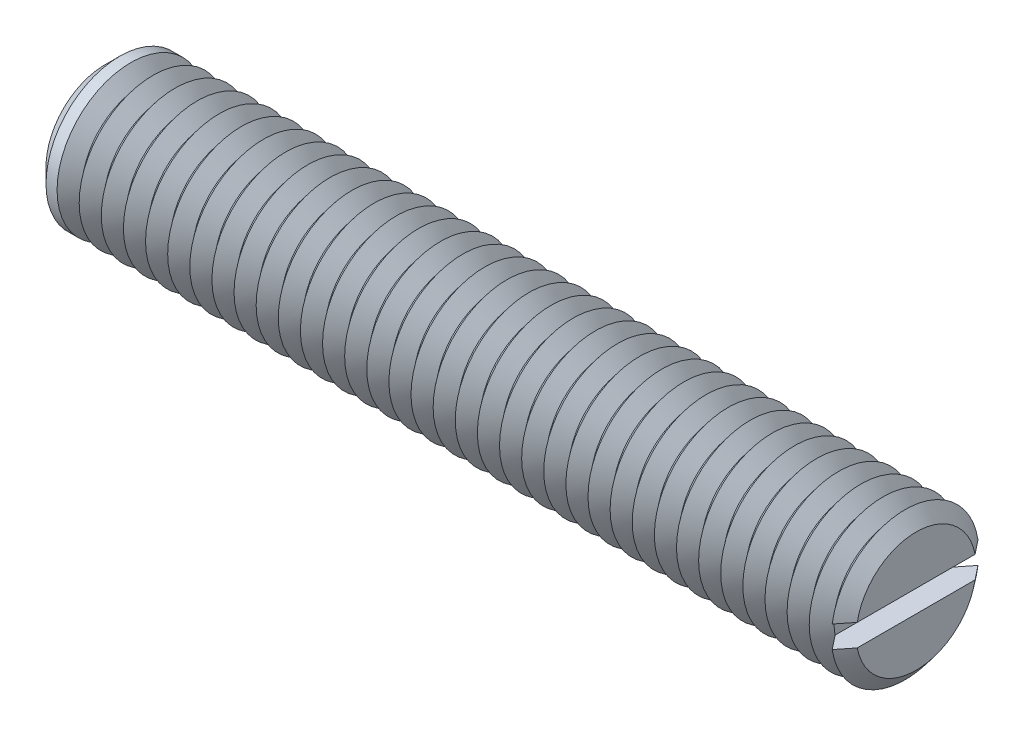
ISO-10303-21;
HEADER;
FILE_DESCRIPTION(('STEP AP214'),'2;1');
FILE_NAME('part.step','',(''),(''),'','','');
FILE_SCHEMA(('AUTOMOTIVE_DESIGN { 1 0 10303 214 1 1 1 1 }'));
ENDSEC;
DATA;
#1=APPLICATION_CONTEXT('core data for automotive mechanical design processes');
#2=APPLICATION_PROTOCOL_DEFINITION('international standard','automotive_design',2000,#1);
#3=PRODUCT_CONTEXT('',#1,'mechanical');
#4=PRODUCT('Part','Part','',(#3));
#5=PRODUCT_RELATED_PRODUCT_CATEGORY('part','',(#4));
#6=PRODUCT_DEFINITION_FORMATION('','',#4);
#7=PRODUCT_DEFINITION_CONTEXT('part definition',#1,'design');
#8=PRODUCT_DEFINITION('design','',#6,#7);
#9=PRODUCT_DEFINITION_SHAPE('','',#8);
#10=(LENGTH_UNIT() NAMED_UNIT(*) SI_UNIT(.MILLI.,.METRE.));
#11=(NAMED_UNIT(*) PLANE_ANGLE_UNIT() SI_UNIT($,.RADIAN.));
#12=(NAMED_UNIT(*) SI_UNIT($,.STERADIAN.) SOLID_ANGLE_UNIT());
#13=UNCERTAINTY_MEASURE_WITH_UNIT(LENGTH_MEASURE(1.E-05),#10,'distance_accuracy_value','');
#14=(GEOMETRIC_REPRESENTATION_CONTEXT(3) GLOBAL_UNCERTAINTY_ASSIGNED_CONTEXT((#13)) GLOBAL_UNIT_ASSIGNED_CONTEXT((#10,
#11,#12)) REPRESENTATION_CONTEXT('',''));
#15=CARTESIAN_POINT('',(0.,0.,0.));
#16=DIRECTION('',(0.,0.,1.));
#17=DIRECTION('',(1.,0.,0.));
#18=AXIS2_PLACEMENT_3D('',#15,#16,#17);
#19=CARTESIAN_POINT('',(26.75,0.,0.));
#20=DIRECTION('',(1.,0.,0.));
#21=DIRECTION('',(0.,0.,-1.));
#22=AXIS2_PLACEMENT_3D('',#19,#20,#21);
#23=CONICAL_SURFACE('',#22,5.,0.895664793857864);
#24=CARTESIAN_POINT('',(26.75,0.,0.));
#25=DIRECTION('',(-1.,0.,0.));
#26=DIRECTION('',(0.,0.,1.));
#27=AXIS2_PLACEMENT_3D('',#24,#25,#26);
#28=CIRCLE('',#27,5.);
#29=CARTESIAN_POINT('',(26.75,-0.75,-4.9434299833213));
#30=VERTEX_POINT('',#29);
#31=CARTESIAN_POINT('',(26.75,-0.75,4.9434299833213));
#32=VERTEX_POINT('',#31);
#33=EDGE_CURVE('E117',#30,#32,#28,.T.);
#34=ORIENTED_EDGE('',*,*,#33,.T.);
#35=CARTESIAN_POINT('',(31.4886555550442,-0.75,-10.8927895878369));
#36=CARTESIAN_POINT('',(31.178663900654,-0.75,-10.5046848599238));
#37=CARTESIAN_POINT('',(30.8687121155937,-0.75,-10.1165482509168));
#38=CARTESIAN_POINT('',(30.2489116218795,-0.75,-9.34012563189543));
#39=CARTESIAN_POINT('',(29.9390629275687,-0.75,-8.95183961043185));
#40=CARTESIAN_POINT('',(29.3189382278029,-0.75,-8.1743381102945));
#41=CARTESIAN_POINT('',(29.0086626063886,-0.75,-7.78512232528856));
#42=CARTESIAN_POINT('',(28.3884400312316,-0.75,-7.00649525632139));
#43=CARTESIAN_POINT('',(28.0784930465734,-0.75,-6.6170839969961));
#44=CARTESIAN_POINT('',(27.6053943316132,-0.75,-6.02191131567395));
#45=CARTESIAN_POINT('',(27.4420627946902,-0.75,-5.81629283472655));
#46=CARTESIAN_POINT('',(27.1155893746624,-0.75,-5.40490151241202));
#47=CARTESIAN_POINT('',(26.9524474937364,-0.75,-5.19912866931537));
#48=CARTESIAN_POINT('',(26.6263799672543,-0.75,-4.78730226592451));
#49=CARTESIAN_POINT('',(26.4634544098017,-0.75,-4.58124863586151));
#50=CARTESIAN_POINT('',(26.138006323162,-0.75,-4.16883695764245));
#51=CARTESIAN_POINT('',(25.9754837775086,-0.75,-3.96247892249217));
#52=CARTESIAN_POINT('',(25.6512888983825,-0.75,-3.54956515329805));
#53=CARTESIAN_POINT('',(25.4896156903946,-0.75,-3.34301010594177));
#54=CARTESIAN_POINT('',(25.1672688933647,-0.75,-2.92906737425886));
#55=CARTESIAN_POINT('',(25.0065954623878,-0.75,-2.72167956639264));
#56=CARTESIAN_POINT('',(24.7671162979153,-0.75,-2.40952296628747));
#57=CARTESIAN_POINT('',(24.687569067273,-0.75,-2.30532351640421));
#58=CARTESIAN_POINT('',(24.5292089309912,-0.75,-2.09636868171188));
#59=CARTESIAN_POINT('',(24.4503960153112,-0.75,-1.99161330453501));
#60=CARTESIAN_POINT('',(24.2939159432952,-0.75,-1.78128982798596));
#61=CARTESIAN_POINT('',(24.2162485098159,-0.75,-1.67572193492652));
#62=CARTESIAN_POINT('',(24.0627483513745,-0.75,-1.46326300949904));
#63=CARTESIAN_POINT('',(23.9869154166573,-0.75,-1.35637213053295));
#64=CARTESIAN_POINT('',(23.8961291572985,-0.75,-1.22407390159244));
#65=CARTESIAN_POINT('',(23.8795740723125,-0.75,-1.19976686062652));
#66=CARTESIAN_POINT('',(23.8466682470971,-0.75,-1.15101442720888));
#67=CARTESIAN_POINT('',(23.8303175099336,-0.75,-1.12656903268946));
#68=CARTESIAN_POINT('',(23.7816161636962,-0.75,-1.05299302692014));
#69=CARTESIAN_POINT('',(23.7496192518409,-0.75,-1.00362669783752));
#70=CARTESIAN_POINT('',(23.6868890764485,-0.75,-0.903957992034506));
#71=CARTESIAN_POINT('',(23.6561584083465,-0.75,-0.853653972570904));
#72=CARTESIAN_POINT('',(23.5966309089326,-0.75,-0.751913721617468));
#73=CARTESIAN_POINT('',(23.5678337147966,-0.75,-0.700477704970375));
#74=CARTESIAN_POINT('',(23.5225435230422,-0.75,-0.613963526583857));
#75=CARTESIAN_POINT('',(23.5052186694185,-0.75,-0.579327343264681));
#76=CARTESIAN_POINT('',(23.4722687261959,-0.75,-0.509265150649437));
#77=CARTESIAN_POINT('',(23.4566439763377,-0.75,-0.473838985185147));
#78=CARTESIAN_POINT('',(23.4132659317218,-0.75,-0.366382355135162));
#79=CARTESIAN_POINT('',(23.3888237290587,-0.75,-0.292842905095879));
#80=CARTESIAN_POINT('',(23.3658405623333,-0.75,-0.189809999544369));
#81=CARTESIAN_POINT('',(23.3606856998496,-0.75,-0.161782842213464));
#82=CARTESIAN_POINT('',(23.3527704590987,-0.75,-0.105398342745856));
#83=CARTESIAN_POINT('',(23.3500088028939,-0.75,-0.0770411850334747));
#84=CARTESIAN_POINT('',(23.3470684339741,-0.75,-0.0202548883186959));
#85=CARTESIAN_POINT('',(23.3468839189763,-0.75,0.00817394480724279));
#86=CARTESIAN_POINT('',(23.3490950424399,-0.75,0.0649322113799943));
#87=CARTESIAN_POINT('',(23.351491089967,-0.75,0.0932616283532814));
#88=CARTESIAN_POINT('',(23.3596937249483,-0.75,0.157351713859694));
#89=CARTESIAN_POINT('',(23.3662565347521,-0.75,0.193015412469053));
#90=CARTESIAN_POINT('',(23.3827020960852,-0.75,0.263573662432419));
#91=CARTESIAN_POINT('',(23.3925874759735,-0.75,0.298467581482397));
#92=CARTESIAN_POINT('',(23.4150598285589,-0.75,0.367652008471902));
#93=CARTESIAN_POINT('',(23.4276667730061,-0.75,0.401935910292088));
#94=CARTESIAN_POINT('',(23.4549130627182,-0.75,0.469664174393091));
#95=CARTESIAN_POINT('',(23.4695519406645,-0.75,0.503108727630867));
#96=CARTESIAN_POINT('',(23.5166350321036,-0.75,0.604259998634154));
#97=CARTESIAN_POINT('',(23.551542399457,-0.75,0.67081090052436));
#98=CARTESIAN_POINT('',(23.6250588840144,-0.75,0.801849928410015));
#99=CARTESIAN_POINT('',(23.6636717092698,-0.75,0.86633590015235));
#100=CARTESIAN_POINT('',(23.7432739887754,-0.75,0.994050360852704));
#101=CARTESIAN_POINT('',(23.784269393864,-0.75,1.057275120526));
#102=CARTESIAN_POINT('',(23.8677403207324,-0.75,1.18274150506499));
#103=CARTESIAN_POINT('',(23.9102160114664,-0.75,1.24498301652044));
#104=CARTESIAN_POINT('',(23.9963066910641,-0.75,1.36895722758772));
#105=CARTESIAN_POINT('',(24.0399248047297,-0.75,1.43068775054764));
#106=CARTESIAN_POINT('',(24.1278819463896,-0.75,1.55364126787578));
#107=CARTESIAN_POINT('',(24.172221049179,-0.75,1.61486420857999));
#108=CARTESIAN_POINT('',(24.2613408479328,-0.75,1.73681254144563));
#109=CARTESIAN_POINT('',(24.3061205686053,-0.75,1.79753864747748));
#110=CARTESIAN_POINT('',(24.3960732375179,-0.75,1.91869503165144));
#111=CARTESIAN_POINT('',(24.4412461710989,-0.75,1.9791253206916));
#112=CARTESIAN_POINT('',(24.576109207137,-0.75,2.15860363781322));
#113=CARTESIAN_POINT('',(24.6662359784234,-0.75,2.27732336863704));
#114=CARTESIAN_POINT('',(24.8472315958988,-0.75,2.51419617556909));
#115=CARTESIAN_POINT('',(24.9381004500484,-0.75,2.63234924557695));
#116=CARTESIAN_POINT('',(25.2114512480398,-0.75,2.98624879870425));
#117=CARTESIAN_POINT('',(25.3946699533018,-0.75,3.22142577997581));
#118=CARTESIAN_POINT('',(25.762238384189,-0.75,3.69117947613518));
#119=CARTESIAN_POINT('',(25.9465888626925,-0.75,3.92575559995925));
#120=CARTESIAN_POINT('',(26.31587911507,-0.75,4.39443534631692));
#121=CARTESIAN_POINT('',(26.500818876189,-0.75,4.62853897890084));
#122=CARTESIAN_POINT('',(26.870331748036,-0.75,5.09551589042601));
#123=CARTESIAN_POINT('',(27.0549033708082,-0.75,5.32839034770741));
#124=CARTESIAN_POINT('',(27.4242990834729,-0.75,5.79394105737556));
#125=CARTESIAN_POINT('',(27.6091231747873,-0.75,6.02661730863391));
#126=CARTESIAN_POINT('',(28.1637745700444,-0.75,6.72433690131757));
#127=CARTESIAN_POINT('',(28.5338620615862,-0.75,7.18917337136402));
#128=CARTESIAN_POINT('',(29.1190458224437,-0.75,7.92356230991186));
#129=CARTESIAN_POINT('',(29.3340169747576,-0.75,8.19321453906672));
#130=CARTESIAN_POINT('',(29.7640698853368,-0.75,8.73245662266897));
#131=CARTESIAN_POINT('',(29.979151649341,-0.75,9.00204647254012));
#132=CARTESIAN_POINT('',(30.4099436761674,-0.75,9.54186292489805));
#133=CARTESIAN_POINT('',(30.6256541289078,-0.75,9.8120893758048));
#134=CARTESIAN_POINT('',(31.0571210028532,-0.75,10.3524795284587));
#135=CARTESIAN_POINT('',(31.2728774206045,-0.75,10.6226432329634));
#136=CARTESIAN_POINT('',(31.4886555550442,-0.75,10.8927895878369));
#137=B_SPLINE_CURVE_WITH_KNOTS('',3,(#35,#36,#37,#38,#39,#40,#41,#42,#43,#44,#45,#46,#47,#48,
#49,#50,#51,#52,#53,#54,#55,#56,#57,#58,#59,#60,#61,#62,#63,#64,#65,#66,#67,#68,#69,#70,#71,#72,
#73,#74,#75,#76,#77,#78,#79,#80,#81,#82,#83,#84,#85,#86,#87,#88,#89,#90,#91,#92,#93,#94,#95,#96,
#97,#98,#99,#100,#101,#102,#103,#104,#105,#106,#107,#108,#109,#110,#111,#112,#113,#114,#115,
#116,#117,#118,#119,#120,#121,#122,#123,#124,#125,#126,#127,#128,#129,#130,#131,#132,#133,#134,
#135,#136),.UNSPECIFIED.,.F.,.F.,(4,2,2,2,2,2,2,2,2,2,2,2,2,2,2,2,2,2,2,2,2,2,2,2,2,2,2,2,2,2,2,
2,2,2,2,2,2,2,2,2,2,2,2,2,2,2,2,2,2,2,4),(0.,1.49012787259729,2.98041311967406,4.47367759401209,
5.96678625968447,6.75457128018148,7.54236526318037,8.33041673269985,9.11843545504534,
9.90534542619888,10.6923767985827,11.0856530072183,11.4789238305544,11.8720978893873,
12.265226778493,12.3534535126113,12.441681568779,12.6181526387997,12.7949690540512,
12.9717521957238,13.0878863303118,13.2040436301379,13.43522465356,13.5206311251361,
13.6059919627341,13.6911605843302,13.7763427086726,13.8849305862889,13.9936045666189,
14.1031049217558,14.2125801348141,14.4377857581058,14.6632191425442,14.8892420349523,
15.1152908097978,15.3420406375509,15.5688141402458,15.7951656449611,16.0215087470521,
16.4686664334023,16.91582892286,17.8101909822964,18.7052318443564,19.6002534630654,
20.4916985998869,21.3831487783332,23.1656575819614,24.2002223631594,25.2348477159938,
26.2721422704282,27.3093757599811),.UNSPECIFIED.);
#138=CARTESIAN_POINT('',(26.,-0.75,3.99343248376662));
#139=VERTEX_POINT('',#138);
#140=EDGE_CURVE('E109',#139,#32,#137,.T.);
#141=ORIENTED_EDGE('',*,*,#140,.F.);
#142=CARTESIAN_POINT('',(26.,0.,0.));
#143=DIRECTION('',(-1.,0.,0.));
#144=DIRECTION('',(0.,0.,1.));
#145=AXIS2_PLACEMENT_3D('',#142,#143,#144);
#146=CIRCLE('',#145,4.06325030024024);
#147=CARTESIAN_POINT('',(26.,-0.75,-3.99343248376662));
#148=VERTEX_POINT('',#147);
#149=EDGE_CURVE('E504',#148,#139,#146,.T.);
#150=ORIENTED_EDGE('',*,*,#149,.F.);
#151=EDGE_CURVE('E58',#30,#148,#137,.T.);
#152=ORIENTED_EDGE('',*,*,#151,.F.);
#153=EDGE_LOOP('',(#34,#141,#150,#152));
#154=FACE_BOUND('',#153,.T.);
#155=ADVANCED_FACE('F37',(#154),#23,.T.);
#156=CARTESIAN_POINT('',(26.75,0.75,4.9434299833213));
#157=VERTEX_POINT('',#156);
#158=CARTESIAN_POINT('',(26.75,0.75,-4.9434299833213));
#159=VERTEX_POINT('',#158);
#160=EDGE_CURVE('E100',#157,#159,#28,.T.);
#161=ORIENTED_EDGE('',*,*,#160,.T.);
#162=CARTESIAN_POINT('',(31.4886555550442,0.75,10.8927895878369));
#163=CARTESIAN_POINT('',(31.178663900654,0.75,10.5046848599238));
#164=CARTESIAN_POINT('',(30.8687121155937,0.75,10.1165482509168));
#165=CARTESIAN_POINT('',(30.2489116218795,0.75,9.34012563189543));
#166=CARTESIAN_POINT('',(29.9390629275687,0.75,8.95183961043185));
#167=CARTESIAN_POINT('',(29.3189382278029,0.75,8.1743381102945));
#168=CARTESIAN_POINT('',(29.0086626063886,0.75,7.78512232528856));
#169=CARTESIAN_POINT('',(28.3884400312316,0.75,7.00649525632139));
#170=CARTESIAN_POINT('',(28.0784930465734,0.75,6.6170839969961));
#171=CARTESIAN_POINT('',(27.6053943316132,0.75,6.02191131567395));
#172=CARTESIAN_POINT('',(27.4420627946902,0.75,5.81629283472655));
#173=CARTESIAN_POINT('',(27.1155893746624,0.75,5.40490151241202));
#174=CARTESIAN_POINT('',(26.9524474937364,0.75,5.19912866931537));
#175=CARTESIAN_POINT('',(26.6263799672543,0.75,4.78730226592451));
#176=CARTESIAN_POINT('',(26.4634544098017,0.75,4.58124863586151));
#177=CARTESIAN_POINT('',(26.138006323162,0.75,4.16883695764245));
#178=CARTESIAN_POINT('',(25.9754837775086,0.75,3.96247892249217));
#179=CARTESIAN_POINT('',(25.6512888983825,0.75,3.54956515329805));
#180=CARTESIAN_POINT('',(25.4896156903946,0.75,3.34301010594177));
#181=CARTESIAN_POINT('',(25.1672688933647,0.75,2.92906737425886));
#182=CARTESIAN_POINT('',(25.0065954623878,0.75,2.72167956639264));
#183=CARTESIAN_POINT('',(24.7671162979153,0.75,2.40952296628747));
#184=CARTESIAN_POINT('',(24.687569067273,0.75,2.30532351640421));
#185=CARTESIAN_POINT('',(24.5292089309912,0.75,2.09636868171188));
#186=CARTESIAN_POINT('',(24.4503960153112,0.75,1.99161330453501));
#187=CARTESIAN_POINT('',(24.2939159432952,0.75,1.78128982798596));
#188=CARTESIAN_POINT('',(24.2162485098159,0.75,1.67572193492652));
#189=CARTESIAN_POINT('',(24.0627483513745,0.75,1.46326300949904));
#190=CARTESIAN_POINT('',(23.9869154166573,0.75,1.35637213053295));
#191=CARTESIAN_POINT('',(23.8961291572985,0.75,1.22407390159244));
#192=CARTESIAN_POINT('',(23.8795740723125,0.75,1.19976686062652));
#193=CARTESIAN_POINT('',(23.8466682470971,0.75,1.15101442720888));
#194=CARTESIAN_POINT('',(23.8303175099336,0.75,1.12656903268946));
#195=CARTESIAN_POINT('',(23.7816161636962,0.75,1.05299302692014));
#196=CARTESIAN_POINT('',(23.7496192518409,0.75,1.00362669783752));
#197=CARTESIAN_POINT('',(23.6868890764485,0.75,0.903957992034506));
#198=CARTESIAN_POINT('',(23.6561584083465,0.75,0.853653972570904));
#199=CARTESIAN_POINT('',(23.5966309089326,0.75,0.751913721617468));
#200=CARTESIAN_POINT('',(23.5678337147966,0.75,0.700477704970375));
#201=CARTESIAN_POINT('',(23.5225435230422,0.75,0.613963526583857));
#202=CARTESIAN_POINT('',(23.5052186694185,0.75,0.579327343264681));
#203=CARTESIAN_POINT('',(23.4722687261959,0.75,0.509265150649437));
#204=CARTESIAN_POINT('',(23.4566439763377,0.75,0.473838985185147));
#205=CARTESIAN_POINT('',(23.4132659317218,0.75,0.366382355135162));
#206=CARTESIAN_POINT('',(23.3888237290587,0.75,0.292842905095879));
#207=CARTESIAN_POINT('',(23.3658405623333,0.75,0.189809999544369));
#208=CARTESIAN_POINT('',(23.3606856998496,0.75,0.161782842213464));
#209=CARTESIAN_POINT('',(23.3527704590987,0.75,0.105398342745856));
#210=CARTESIAN_POINT('',(23.3500088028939,0.75,0.0770411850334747));
#211=CARTESIAN_POINT('',(23.3470684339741,0.75,0.0202548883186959));
#212=CARTESIAN_POINT('',(23.3468839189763,0.75,-0.00817394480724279));
#213=CARTESIAN_POINT('',(23.3490950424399,0.75,-0.0649322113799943));
#214=CARTESIAN_POINT('',(23.351491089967,0.75,-0.0932616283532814));
#215=CARTESIAN_POINT('',(23.3596937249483,0.75,-0.157351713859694));
#216=CARTESIAN_POINT('',(23.3662565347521,0.75,-0.193015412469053));
#217=CARTESIAN_POINT('',(23.3827020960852,0.75,-0.263573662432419));
#218=CARTESIAN_POINT('',(23.3925874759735,0.75,-0.298467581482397));
#219=CARTESIAN_POINT('',(23.4150598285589,0.75,-0.367652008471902));
#220=CARTESIAN_POINT('',(23.4276667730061,0.75,-0.401935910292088));
#221=CARTESIAN_POINT('',(23.4549130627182,0.75,-0.469664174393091));
#222=CARTESIAN_POINT('',(23.4695519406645,0.75,-0.503108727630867));
#223=CARTESIAN_POINT('',(23.5166350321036,0.75,-0.604259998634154));
#224=CARTESIAN_POINT('',(23.551542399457,0.75,-0.67081090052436));
#225=CARTESIAN_POINT('',(23.6250588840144,0.75,-0.801849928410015));
#226=CARTESIAN_POINT('',(23.6636717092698,0.75,-0.86633590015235));
#227=CARTESIAN_POINT('',(23.7432739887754,0.75,-0.994050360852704));
#228=CARTESIAN_POINT('',(23.784269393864,0.75,-1.057275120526));
#229=CARTESIAN_POINT('',(23.8677403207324,0.75,-1.18274150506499));
#230=CARTESIAN_POINT('',(23.9102160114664,0.75,-1.24498301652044));
#231=CARTESIAN_POINT('',(23.9963066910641,0.75,-1.36895722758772));
#232=CARTESIAN_POINT('',(24.0399248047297,0.75,-1.43068775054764));
#233=CARTESIAN_POINT('',(24.1278819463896,0.75,-1.55364126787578));
#234=CARTESIAN_POINT('',(24.172221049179,0.75,-1.61486420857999));
#235=CARTESIAN_POINT('',(24.2613408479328,0.75,-1.73681254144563));
#236=CARTESIAN_POINT('',(24.3061205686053,0.75,-1.79753864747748));
#237=CARTESIAN_POINT('',(24.3960732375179,0.75,-1.91869503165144));
#238=CARTESIAN_POINT('',(24.4412461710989,0.75,-1.9791253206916));
#239=CARTESIAN_POINT('',(24.576109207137,0.75,-2.15860363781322));
#240=CARTESIAN_POINT('',(24.6662359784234,0.75,-2.27732336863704));
#241=CARTESIAN_POINT('',(24.8472315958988,0.75,-2.51419617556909));
#242=CARTESIAN_POINT('',(24.9381004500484,0.75,-2.63234924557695));
#243=CARTESIAN_POINT('',(25.2114512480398,0.75,-2.98624879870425));
#244=CARTESIAN_POINT('',(25.3946699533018,0.75,-3.22142577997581));
#245=CARTESIAN_POINT('',(25.762238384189,0.75,-3.69117947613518));
#246=CARTESIAN_POINT('',(25.9465888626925,0.75,-3.92575559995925));
#247=CARTESIAN_POINT('',(26.31587911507,0.75,-4.39443534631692));
#248=CARTESIAN_POINT('',(26.500818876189,0.75,-4.62853897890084));
#249=CARTESIAN_POINT('',(26.870331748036,0.75,-5.09551589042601));
#250=CARTESIAN_POINT('',(27.0549033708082,0.75,-5.32839034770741));
#251=CARTESIAN_POINT('',(27.4242990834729,0.75,-5.79394105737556));
#252=CARTESIAN_POINT('',(27.6091231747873,0.75,-6.02661730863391));
#253=CARTESIAN_POINT('',(28.1637745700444,0.75,-6.72433690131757));
#254=CARTESIAN_POINT('',(28.5338620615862,0.75,-7.18917337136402));
#255=CARTESIAN_POINT('',(29.1190458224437,0.75,-7.92356230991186));
#256=CARTESIAN_POINT('',(29.3340169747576,0.75,-8.19321453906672));
#257=CARTESIAN_POINT('',(29.7640698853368,0.75,-8.73245662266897));
#258=CARTESIAN_POINT('',(29.979151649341,0.75,-9.00204647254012));
#259=CARTESIAN_POINT('',(30.4099436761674,0.75,-9.54186292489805));
#260=CARTESIAN_POINT('',(30.6256541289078,0.75,-9.8120893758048));
#261=CARTESIAN_POINT('',(31.0571210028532,0.75,-10.3524795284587));
#262=CARTESIAN_POINT('',(31.2728774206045,0.75,-10.6226432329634));
#263=CARTESIAN_POINT('',(31.4886555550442,0.75,-10.8927895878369));
#264=B_SPLINE_CURVE_WITH_KNOTS('',3,(#162,#163,#164,#165,#166,#167,#168,#169,#170,#171,#172,
#173,#174,#175,#176,#177,#178,#179,#180,#181,#182,#183,#184,#185,#186,#187,#188,#189,#190,#191,
#192,#193,#194,#195,#196,#197,#198,#199,#200,#201,#202,#203,#204,#205,#206,#207,#208,#209,#210,
#211,#212,#213,#214,#215,#216,#217,#218,#219,#220,#221,#222,#223,#224,#225,#226,#227,#228,#229,
#230,#231,#232,#233,#234,#235,#236,#237,#238,#239,#240,#241,#242,#243,#244,#245,#246,#247,#248,
#249,#250,#251,#252,#253,#254,#255,#256,#257,#258,#259,#260,#261,#262,#263),.UNSPECIFIED.,.F.,
.F.,(4,2,2,2,2,2,2,2,2,2,2,2,2,2,2,2,2,2,2,2,2,2,2,2,2,2,2,2,2,2,2,2,2,2,2,2,2,2,2,2,2,2,2,2,2,
2,2,2,2,2,4),(0.,1.49012787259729,2.98041311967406,4.47367759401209,5.96678625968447,
6.75457128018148,7.54236526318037,8.33041673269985,9.11843545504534,9.90534542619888,
10.6923767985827,11.0856530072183,11.4789238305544,11.8720978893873,12.265226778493,
12.3534535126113,12.441681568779,12.6181526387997,12.7949690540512,12.9717521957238,
13.0878863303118,13.2040436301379,13.43522465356,13.5206311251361,13.6059919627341,
13.6911605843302,13.7763427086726,13.8849305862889,13.9936045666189,14.1031049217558,
14.2125801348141,14.4377857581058,14.6632191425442,14.8892420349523,15.1152908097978,
15.3420406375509,15.5688141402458,15.7951656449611,16.0215087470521,16.4686664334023,
16.91582892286,17.8101909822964,18.7052318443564,19.6002534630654,20.4916985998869,
21.3831487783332,23.1656575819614,24.2002223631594,25.2348477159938,26.2721422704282,
27.3093757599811),.UNSPECIFIED.);
#265=CARTESIAN_POINT('',(26.,0.75,-3.99343248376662));
#266=VERTEX_POINT('',#265);
#267=EDGE_CURVE('E110',#266,#159,#264,.T.);
#268=ORIENTED_EDGE('',*,*,#267,.F.);
#269=CARTESIAN_POINT('',(26.,0.75,3.99343248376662));
#270=VERTEX_POINT('',#269);
#271=EDGE_CURVE('E103',#270,#266,#146,.T.);
#272=ORIENTED_EDGE('',*,*,#271,.F.);
#273=EDGE_CURVE('E97',#157,#270,#264,.T.);
#274=ORIENTED_EDGE('',*,*,#273,.F.);
#275=EDGE_LOOP('',(#161,#268,#272,#274));
#276=FACE_BOUND('',#275,.T.);
#277=ADVANCED_FACE('F99',(#276),#23,.T.);
#278=CARTESIAN_POINT('',(26.,0.,0.));
#279=DIRECTION('',(-1.,0.,0.));
#280=DIRECTION('',(0.,0.,1.));
#281=AXIS2_PLACEMENT_3D('',#278,#279,#280);
#282=CONICAL_SURFACE('',#281,4.06325030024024,0.895664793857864);
#283=CARTESIAN_POINT('',(25.25,0.,0.));
#284=DIRECTION('',(-1.,0.,0.));
#285=DIRECTION('',(0.,0.,1.));
#286=AXIS2_PLACEMENT_3D('',#283,#284,#285);
#287=CIRCLE('',#286,5.);
#288=CARTESIAN_POINT('',(25.25,0.,5.));
#289=VERTEX_POINT('',#288);
#290=EDGE_CURVE('E489',#289,#289,#287,.T.);
#291=ORIENTED_EDGE('',*,*,#290,.F.);
#292=EDGE_LOOP('',(#291));
#293=FACE_BOUND('',#292,.T.);
#294=ORIENTED_EDGE('',*,*,#271,.T.);
#295=EDGE_CURVE('E498',#266,#148,#146,.T.);
#296=ORIENTED_EDGE('',*,*,#295,.T.);
#297=ORIENTED_EDGE('',*,*,#149,.T.);
#298=EDGE_CURVE('E496',#139,#270,#146,.T.);
#299=ORIENTED_EDGE('',*,*,#298,.T.);
#300=EDGE_LOOP('',(#294,#296,#297,#299));
#301=FACE_BOUND('',#300,.T.);
#302=ADVANCED_FACE('F168',(#293,#301),#282,.T.);
#303=CARTESIAN_POINT('',(27.5,0.,0.));
#304=DIRECTION('',(1.,0.,0.));
#305=DIRECTION('',(0.,0.,-1.));
#306=AXIS2_PLACEMENT_3D('',#303,#304,#305);
#307=PLANE('',#306);
#308=CARTESIAN_POINT('',(27.5,0.,0.));
#309=DIRECTION('',(-1.,0.,0.));
#310=DIRECTION('',(0.,0.,1.));
#311=AXIS2_PLACEMENT_3D('',#308,#309,#310);
#312=CIRCLE('',#311,4.06325030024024);
#313=CARTESIAN_POINT('',(27.5,0.75,3.99343248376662));
#314=VERTEX_POINT('',#313);
#315=CARTESIAN_POINT('',(27.5,0.75,-3.99343248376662));
#316=VERTEX_POINT('',#315);
#317=EDGE_CURVE('E160',#314,#316,#312,.T.);
#318=ORIENTED_EDGE('',*,*,#317,.F.);
#319=DIRECTION('',(0.,0.,1.));
#320=VECTOR('',#319,1.);
#321=CARTESIAN_POINT('',(27.5,0.75,0.));
#322=LINE('',#321,#320);
#323=EDGE_CURVE('E122',#316,#314,#322,.T.);
#324=ORIENTED_EDGE('',*,*,#323,.F.);
#325=EDGE_LOOP('',(#318,#324));
#326=FACE_BOUND('',#325,.T.);
#327=ADVANCED_FACE('F172',(#326),#307,.T.);
#328=CARTESIAN_POINT('',(27.5,-0.75,-3.99343248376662));
#329=VERTEX_POINT('',#328);
#330=CARTESIAN_POINT('',(27.5,-0.75,3.99343248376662));
#331=VERTEX_POINT('',#330);
#332=EDGE_CURVE('E66',#329,#331,#312,.T.);
#333=ORIENTED_EDGE('',*,*,#332,.F.);
#334=DIRECTION('',(0.,0.,-1.));
#335=VECTOR('',#334,1.);
#336=CARTESIAN_POINT('',(27.5,-0.75,0.));
#337=LINE('',#336,#335);
#338=EDGE_CURVE('E136',#331,#329,#337,.T.);
#339=ORIENTED_EDGE('',*,*,#338,.F.);
#340=EDGE_LOOP('',(#333,#339));
#341=FACE_BOUND('',#340,.T.);
#342=ADVANCED_FACE('F202',(#341),#307,.T.);
#343=CARTESIAN_POINT('',(27.5,0.,0.));
#344=DIRECTION('',(-1.,0.,0.));
#345=DIRECTION('',(0.,0.,1.));
#346=AXIS2_PLACEMENT_3D('',#343,#344,#345);
#347=CONICAL_SURFACE('',#346,4.06325030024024,0.895664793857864);
#348=ORIENTED_EDGE('',*,*,#160,.F.);
#349=CARTESIAN_POINT('',(22.0113444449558,0.75,-10.8927895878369));
#350=CARTESIAN_POINT('',(22.321336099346,0.75,-10.5046848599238));
#351=CARTESIAN_POINT('',(22.6312878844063,0.75,-10.1165482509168));
#352=CARTESIAN_POINT('',(23.2510883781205,0.75,-9.34012563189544));
#353=CARTESIAN_POINT('',(23.5609370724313,0.75,-8.95183961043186));
#354=CARTESIAN_POINT('',(24.1810617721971,0.75,-8.17433811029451));
#355=CARTESIAN_POINT('',(24.4913373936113,0.75,-7.78512232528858));
#356=CARTESIAN_POINT('',(25.1115599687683,0.75,-7.00649525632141));
#357=CARTESIAN_POINT('',(25.4215069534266,0.75,-6.61708399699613));
#358=CARTESIAN_POINT('',(25.8946056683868,0.75,-6.02191131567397));
#359=CARTESIAN_POINT('',(26.0579372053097,0.75,-5.81629283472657));
#360=CARTESIAN_POINT('',(26.3844106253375,0.75,-5.40490151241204));
#361=CARTESIAN_POINT('',(26.5475525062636,0.75,-5.19912866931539));
#362=CARTESIAN_POINT('',(26.8736200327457,0.75,-4.78730226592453));
#363=CARTESIAN_POINT('',(27.0365455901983,0.75,-4.58124863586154));
#364=CARTESIAN_POINT('',(27.361993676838,0.75,-4.16883695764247));
#365=CARTESIAN_POINT('',(27.5245162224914,0.75,-3.96247892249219));
#366=CARTESIAN_POINT('',(27.8487111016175,0.75,-3.54956515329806));
#367=CARTESIAN_POINT('',(28.0103843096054,0.75,-3.34301010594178));
#368=CARTESIAN_POINT('',(28.3327311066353,0.75,-2.92906737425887));
#369=CARTESIAN_POINT('',(28.4934045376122,0.75,-2.72167956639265));
#370=CARTESIAN_POINT('',(28.7328837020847,0.75,-2.40952296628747));
#371=CARTESIAN_POINT('',(28.812430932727,0.75,-2.30532351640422));
#372=CARTESIAN_POINT('',(28.9707910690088,0.75,-2.09636868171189));
#373=CARTESIAN_POINT('',(29.0496039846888,0.75,-1.99161330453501));
#374=CARTESIAN_POINT('',(29.2060840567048,0.75,-1.78128982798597));
#375=CARTESIAN_POINT('',(29.2837514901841,0.75,-1.67572193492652));
#376=CARTESIAN_POINT('',(29.4372516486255,0.75,-1.46326300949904));
#377=CARTESIAN_POINT('',(29.5130845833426,0.75,-1.35637213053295));
#378=CARTESIAN_POINT('',(29.6038708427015,0.75,-1.22407390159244));
#379=CARTESIAN_POINT('',(29.6204259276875,0.75,-1.19976686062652));
#380=CARTESIAN_POINT('',(29.6533317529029,0.75,-1.15101442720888));
#381=CARTESIAN_POINT('',(29.6696824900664,0.75,-1.12656903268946));
#382=CARTESIAN_POINT('',(29.7183838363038,0.75,-1.05299302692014));
#383=CARTESIAN_POINT('',(29.7503807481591,0.75,-1.00362669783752));
#384=CARTESIAN_POINT('',(29.8131109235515,0.75,-0.903957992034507));
#385=CARTESIAN_POINT('',(29.8438415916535,0.75,-0.853653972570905));
#386=CARTESIAN_POINT('',(29.9033690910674,0.75,-0.751913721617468));
#387=CARTESIAN_POINT('',(29.9321662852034,0.75,-0.700477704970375));
#388=CARTESIAN_POINT('',(29.9774564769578,0.75,-0.613963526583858));
#389=CARTESIAN_POINT('',(29.9947813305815,0.75,-0.579327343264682));
#390=CARTESIAN_POINT('',(30.0277312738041,0.75,-0.509265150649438));
#391=CARTESIAN_POINT('',(30.0433560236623,0.75,-0.473838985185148));
#392=CARTESIAN_POINT('',(30.0867340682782,0.75,-0.366382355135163));
#393=CARTESIAN_POINT('',(30.1111762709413,0.75,-0.29284290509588));
#394=CARTESIAN_POINT('',(30.1341594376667,0.75,-0.189809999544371));
#395=CARTESIAN_POINT('',(30.1393143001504,0.75,-0.161782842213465));
#396=CARTESIAN_POINT('',(30.1472295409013,0.75,-0.105398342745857));
#397=CARTESIAN_POINT('',(30.1499911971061,0.75,-0.077041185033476));
#398=CARTESIAN_POINT('',(30.1529315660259,0.75,-0.0202548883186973));
#399=CARTESIAN_POINT('',(30.1531160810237,0.75,0.00817394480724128));
#400=CARTESIAN_POINT('',(30.1509049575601,0.75,0.0649322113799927));
#401=CARTESIAN_POINT('',(30.148508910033,0.75,0.09326162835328));
#402=CARTESIAN_POINT('',(30.1403062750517,0.75,0.157351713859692));
#403=CARTESIAN_POINT('',(30.1337434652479,0.75,0.193015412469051));
#404=CARTESIAN_POINT('',(30.1172979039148,0.75,0.263573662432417));
#405=CARTESIAN_POINT('',(30.1074125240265,0.75,0.298467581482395));
#406=CARTESIAN_POINT('',(30.0849401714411,0.75,0.367652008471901));
#407=CARTESIAN_POINT('',(30.0723332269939,0.75,0.401935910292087));
#408=CARTESIAN_POINT('',(30.0450869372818,0.75,0.46966417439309));
#409=CARTESIAN_POINT('',(30.0304480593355,0.75,0.503108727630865));
#410=CARTESIAN_POINT('',(29.9833649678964,0.75,0.604259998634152));
#411=CARTESIAN_POINT('',(29.948457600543,0.75,0.670810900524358));
#412=CARTESIAN_POINT('',(29.8749411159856,0.75,0.801849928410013));
#413=CARTESIAN_POINT('',(29.8363282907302,0.75,0.866335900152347));
#414=CARTESIAN_POINT('',(29.7567260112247,0.75,0.994050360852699));
#415=CARTESIAN_POINT('',(29.7157306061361,0.75,1.05727512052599));
#416=CARTESIAN_POINT('',(29.6322596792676,0.75,1.18274150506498));
#417=CARTESIAN_POINT('',(29.5897839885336,0.75,1.24498301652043));
#418=CARTESIAN_POINT('',(29.5036933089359,0.75,1.36895722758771));
#419=CARTESIAN_POINT('',(29.4600751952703,0.75,1.43068775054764));
#420=CARTESIAN_POINT('',(29.3721180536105,0.75,1.55364126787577));
#421=CARTESIAN_POINT('',(29.327778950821,0.75,1.61486420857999));
#422=CARTESIAN_POINT('',(29.2386591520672,0.75,1.73681254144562));
#423=CARTESIAN_POINT('',(29.1938794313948,0.75,1.79753864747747));
#424=CARTESIAN_POINT('',(29.1039267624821,0.75,1.91869503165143));
#425=CARTESIAN_POINT('',(29.0587538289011,0.75,1.97912532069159));
#426=CARTESIAN_POINT('',(28.923890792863,0.75,2.15860363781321));
#427=CARTESIAN_POINT('',(28.8337640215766,0.75,2.27732336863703));
#428=CARTESIAN_POINT('',(28.6527684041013,0.75,2.51419617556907));
#429=CARTESIAN_POINT('',(28.5618995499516,0.75,2.63234924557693));
#430=CARTESIAN_POINT('',(28.2885487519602,0.75,2.98624879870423));
#431=CARTESIAN_POINT('',(28.1053300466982,0.75,3.2214257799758));
#432=CARTESIAN_POINT('',(27.737761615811,0.75,3.69117947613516));
#433=CARTESIAN_POINT('',(27.5534111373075,0.75,3.92575559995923));
#434=CARTESIAN_POINT('',(27.18412088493,0.75,4.39443534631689));
#435=CARTESIAN_POINT('',(26.999181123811,0.75,4.62853897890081));
#436=CARTESIAN_POINT('',(26.629668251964,0.75,5.09551589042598));
#437=CARTESIAN_POINT('',(26.4450966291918,0.75,5.32839034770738));
#438=CARTESIAN_POINT('',(26.0757009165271,0.75,5.79394105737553));
#439=CARTESIAN_POINT('',(25.8908768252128,0.75,6.02661730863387));
#440=CARTESIAN_POINT('',(25.3362254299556,0.75,6.72433690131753));
#441=CARTESIAN_POINT('',(24.9661379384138,0.75,7.18917337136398));
#442=CARTESIAN_POINT('',(24.3809541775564,0.75,7.92356230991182));
#443=CARTESIAN_POINT('',(24.1659830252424,0.75,8.19321453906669));
#444=CARTESIAN_POINT('',(23.7359301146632,0.75,8.73245662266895));
#445=CARTESIAN_POINT('',(23.520848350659,0.75,9.0020464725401));
#446=CARTESIAN_POINT('',(23.0900563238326,0.75,9.54186292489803));
#447=CARTESIAN_POINT('',(22.8743458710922,0.75,9.81208937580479));
#448=CARTESIAN_POINT('',(22.4428789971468,0.75,10.3524795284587));
#449=CARTESIAN_POINT('',(22.2271225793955,0.75,10.6226432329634));
#450=CARTESIAN_POINT('',(22.0113444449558,0.75,10.8927895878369));
#451=B_SPLINE_CURVE_WITH_KNOTS('',3,(#349,#350,#351,#352,#353,#354,#355,#356,#357,#358,#359,
#360,#361,#362,#363,#364,#365,#366,#367,#368,#369,#370,#371,#372,#373,#374,#375,#376,#377,#378,
#379,#380,#381,#382,#383,#384,#385,#386,#387,#388,#389,#390,#391,#392,#393,#394,#395,#396,#397,
#398,#399,#400,#401,#402,#403,#404,#405,#406,#407,#408,#409,#410,#411,#412,#413,#414,#415,#416,
#417,#418,#419,#420,#421,#422,#423,#424,#425,#426,#427,#428,#429,#430,#431,#432,#433,#434,#435,
#436,#437,#438,#439,#440,#441,#442,#443,#444,#445,#446,#447,#448,#449,#450),.UNSPECIFIED.,.F.,
.F.,(4,2,2,2,2,2,2,2,2,2,2,2,2,2,2,2,2,2,2,2,2,2,2,2,2,2,2,2,2,2,2,2,2,2,2,2,2,2,2,2,2,2,2,2,2,
2,2,2,2,2,4),(0.,1.49012787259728,2.98041311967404,4.47367759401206,5.96678625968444,
6.75457128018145,7.54236526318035,8.33041673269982,9.11843545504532,9.90534542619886,
10.6923767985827,11.0856530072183,11.4789238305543,11.8720978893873,12.265226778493,
12.3534535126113,12.441681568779,12.6181526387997,12.7949690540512,12.9717521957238,
13.0878863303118,13.2040436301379,13.43522465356,13.5206311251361,13.6059919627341,
13.6911605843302,13.7763427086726,13.8849305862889,13.9936045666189,14.1031049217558,
14.2125801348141,14.4377857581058,14.6632191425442,14.8892420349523,15.1152908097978,
15.3420406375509,15.5688141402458,15.795165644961,16.0215087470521,16.4686664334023,
16.91582892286,17.8101909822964,18.7052318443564,19.6002534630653,20.4916985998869,
21.3831487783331,23.1656575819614,24.2002223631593,25.2348477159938,26.2721422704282,
27.3093757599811),.UNSPECIFIED.);
#452=EDGE_CURVE('E41',#314,#157,#451,.T.);
#453=ORIENTED_EDGE('',*,*,#452,.F.);
#454=ORIENTED_EDGE('',*,*,#317,.T.);
#455=EDGE_CURVE('E11',#159,#316,#451,.T.);
#456=ORIENTED_EDGE('',*,*,#455,.F.);
#457=EDGE_LOOP('',(#348,#453,#454,#456));
#458=FACE_BOUND('',#457,.T.);
#459=ADVANCED_FACE('F114',(#458),#347,.T.);
#460=CARTESIAN_POINT('',(27.5,0.75,-7.5));
#461=DIRECTION('',(0.,1.,0.));
#462=DIRECTION('',(0.,0.,1.));
#463=AXIS2_PLACEMENT_3D('',#460,#461,#462);
#464=PLANE('',#463);
#465=ORIENTED_EDGE('',*,*,#452,.T.);
#466=ORIENTED_EDGE('',*,*,#273,.T.);
#467=DIRECTION('',(0.,0.,1.));
#468=VECTOR('',#467,1.);
#469=CARTESIAN_POINT('',(26.,0.75,-7.5));
#470=LINE('',#469,#468);
#471=EDGE_CURVE('E145',#266,#270,#470,.T.);
#472=ORIENTED_EDGE('',*,*,#471,.F.);
#473=ORIENTED_EDGE('',*,*,#267,.T.);
#474=ORIENTED_EDGE('',*,*,#455,.T.);
#475=ORIENTED_EDGE('',*,*,#323,.T.);
#476=EDGE_LOOP('',(#465,#466,#472,#473,#474,#475));
#477=FACE_BOUND('',#476,.T.);
#478=ADVANCED_FACE('F120',(#477),#464,.F.);
#479=ORIENTED_EDGE('',*,*,#33,.F.);
#480=CARTESIAN_POINT('',(22.0113444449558,-0.75,10.8927895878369));
#481=CARTESIAN_POINT('',(22.321336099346,-0.75,10.5046848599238));
#482=CARTESIAN_POINT('',(22.6312878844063,-0.75,10.1165482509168));
#483=CARTESIAN_POINT('',(23.2510883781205,-0.75,9.34012563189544));
#484=CARTESIAN_POINT('',(23.5609370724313,-0.75,8.95183961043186));
#485=CARTESIAN_POINT('',(24.1810617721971,-0.75,8.17433811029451));
#486=CARTESIAN_POINT('',(24.4913373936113,-0.75,7.78512232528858));
#487=CARTESIAN_POINT('',(25.1115599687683,-0.75,7.00649525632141));
#488=CARTESIAN_POINT('',(25.4215069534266,-0.75,6.61708399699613));
#489=CARTESIAN_POINT('',(25.8946056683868,-0.75,6.02191131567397));
#490=CARTESIAN_POINT('',(26.0579372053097,-0.75,5.81629283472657));
#491=CARTESIAN_POINT('',(26.3844106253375,-0.75,5.40490151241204));
#492=CARTESIAN_POINT('',(26.5475525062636,-0.75,5.19912866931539));
#493=CARTESIAN_POINT('',(26.8736200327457,-0.75,4.78730226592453));
#494=CARTESIAN_POINT('',(27.0365455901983,-0.75,4.58124863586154));
#495=CARTESIAN_POINT('',(27.361993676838,-0.75,4.16883695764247));
#496=CARTESIAN_POINT('',(27.5245162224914,-0.75,3.96247892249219));
#497=CARTESIAN_POINT('',(27.8487111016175,-0.75,3.54956515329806));
#498=CARTESIAN_POINT('',(28.0103843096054,-0.75,3.34301010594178));
#499=CARTESIAN_POINT('',(28.3327311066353,-0.75,2.92906737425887));
#500=CARTESIAN_POINT('',(28.4934045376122,-0.75,2.72167956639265));
#501=CARTESIAN_POINT('',(28.7328837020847,-0.75,2.40952296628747));
#502=CARTESIAN_POINT('',(28.812430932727,-0.75,2.30532351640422));
#503=CARTESIAN_POINT('',(28.9707910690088,-0.75,2.09636868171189));
#504=CARTESIAN_POINT('',(29.0496039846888,-0.75,1.99161330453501));
#505=CARTESIAN_POINT('',(29.2060840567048,-0.75,1.78128982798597));
#506=CARTESIAN_POINT('',(29.2837514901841,-0.75,1.67572193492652));
#507=CARTESIAN_POINT('',(29.4372516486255,-0.75,1.46326300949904));
#508=CARTESIAN_POINT('',(29.5130845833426,-0.75,1.35637213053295));
#509=CARTESIAN_POINT('',(29.6038708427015,-0.75,1.22407390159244));
#510=CARTESIAN_POINT('',(29.6204259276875,-0.75,1.19976686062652));
#511=CARTESIAN_POINT('',(29.6533317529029,-0.75,1.15101442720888));
#512=CARTESIAN_POINT('',(29.6696824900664,-0.75,1.12656903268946));
#513=CARTESIAN_POINT('',(29.7183838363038,-0.75,1.05299302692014));
#514=CARTESIAN_POINT('',(29.7503807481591,-0.75,1.00362669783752));
#515=CARTESIAN_POINT('',(29.8131109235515,-0.75,0.903957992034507));
#516=CARTESIAN_POINT('',(29.8438415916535,-0.75,0.853653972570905));
#517=CARTESIAN_POINT('',(29.9033690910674,-0.75,0.751913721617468));
#518=CARTESIAN_POINT('',(29.9321662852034,-0.75,0.700477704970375));
#519=CARTESIAN_POINT('',(29.9774564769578,-0.75,0.613963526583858));
#520=CARTESIAN_POINT('',(29.9947813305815,-0.75,0.579327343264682));
#521=CARTESIAN_POINT('',(30.0277312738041,-0.75,0.509265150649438));
#522=CARTESIAN_POINT('',(30.0433560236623,-0.75,0.473838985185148));
#523=CARTESIAN_POINT('',(30.0867340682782,-0.75,0.366382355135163));
#524=CARTESIAN_POINT('',(30.1111762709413,-0.75,0.29284290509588));
#525=CARTESIAN_POINT('',(30.1341594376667,-0.75,0.189809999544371));
#526=CARTESIAN_POINT('',(30.1393143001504,-0.75,0.161782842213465));
#527=CARTESIAN_POINT('',(30.1472295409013,-0.75,0.105398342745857));
#528=CARTESIAN_POINT('',(30.1499911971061,-0.75,0.077041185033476));
#529=CARTESIAN_POINT('',(30.1529315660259,-0.75,0.0202548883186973));
#530=CARTESIAN_POINT('',(30.1531160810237,-0.75,-0.00817394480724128));
#531=CARTESIAN_POINT('',(30.1509049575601,-0.75,-0.0649322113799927));
#532=CARTESIAN_POINT('',(30.148508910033,-0.75,-0.09326162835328));
#533=CARTESIAN_POINT('',(30.1403062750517,-0.75,-0.157351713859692));
#534=CARTESIAN_POINT('',(30.1337434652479,-0.75,-0.193015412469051));
#535=CARTESIAN_POINT('',(30.1172979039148,-0.75,-0.263573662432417));
#536=CARTESIAN_POINT('',(30.1074125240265,-0.75,-0.298467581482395));
#537=CARTESIAN_POINT('',(30.0849401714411,-0.75,-0.367652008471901));
#538=CARTESIAN_POINT('',(30.0723332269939,-0.75,-0.401935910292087));
#539=CARTESIAN_POINT('',(30.0450869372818,-0.75,-0.46966417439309));
#540=CARTESIAN_POINT('',(30.0304480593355,-0.75,-0.503108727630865));
#541=CARTESIAN_POINT('',(29.9833649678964,-0.75,-0.604259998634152));
#542=CARTESIAN_POINT('',(29.948457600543,-0.75,-0.670810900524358));
#543=CARTESIAN_POINT('',(29.8749411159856,-0.75,-0.801849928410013));
#544=CARTESIAN_POINT('',(29.8363282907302,-0.75,-0.866335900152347));
#545=CARTESIAN_POINT('',(29.7567260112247,-0.75,-0.994050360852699));
#546=CARTESIAN_POINT('',(29.7157306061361,-0.75,-1.05727512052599));
#547=CARTESIAN_POINT('',(29.6322596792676,-0.75,-1.18274150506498));
#548=CARTESIAN_POINT('',(29.5897839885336,-0.75,-1.24498301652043));
#549=CARTESIAN_POINT('',(29.5036933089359,-0.75,-1.36895722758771));
#550=CARTESIAN_POINT('',(29.4600751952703,-0.75,-1.43068775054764));
#551=CARTESIAN_POINT('',(29.3721180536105,-0.75,-1.55364126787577));
#552=CARTESIAN_POINT('',(29.327778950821,-0.75,-1.61486420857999));
#553=CARTESIAN_POINT('',(29.2386591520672,-0.75,-1.73681254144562));
#554=CARTESIAN_POINT('',(29.1938794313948,-0.75,-1.79753864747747));
#555=CARTESIAN_POINT('',(29.1039267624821,-0.75,-1.91869503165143));
#556=CARTESIAN_POINT('',(29.0587538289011,-0.75,-1.97912532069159));
#557=CARTESIAN_POINT('',(28.923890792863,-0.75,-2.15860363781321));
#558=CARTESIAN_POINT('',(28.8337640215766,-0.75,-2.27732336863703));
#559=CARTESIAN_POINT('',(28.6527684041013,-0.75,-2.51419617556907));
#560=CARTESIAN_POINT('',(28.5618995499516,-0.75,-2.63234924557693));
#561=CARTESIAN_POINT('',(28.2885487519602,-0.75,-2.98624879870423));
#562=CARTESIAN_POINT('',(28.1053300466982,-0.75,-3.2214257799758));
#563=CARTESIAN_POINT('',(27.737761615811,-0.75,-3.69117947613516));
#564=CARTESIAN_POINT('',(27.5534111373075,-0.75,-3.92575559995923));
#565=CARTESIAN_POINT('',(27.18412088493,-0.75,-4.39443534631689));
#566=CARTESIAN_POINT('',(26.999181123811,-0.75,-4.62853897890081));
#567=CARTESIAN_POINT('',(26.629668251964,-0.75,-5.09551589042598));
#568=CARTESIAN_POINT('',(26.4450966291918,-0.75,-5.32839034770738));
#569=CARTESIAN_POINT('',(26.0757009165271,-0.75,-5.79394105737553));
#570=CARTESIAN_POINT('',(25.8908768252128,-0.75,-6.02661730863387));
#571=CARTESIAN_POINT('',(25.3362254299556,-0.75,-6.72433690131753));
#572=CARTESIAN_POINT('',(24.9661379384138,-0.75,-7.18917337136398));
#573=CARTESIAN_POINT('',(24.3809541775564,-0.75,-7.92356230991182));
#574=CARTESIAN_POINT('',(24.1659830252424,-0.75,-8.19321453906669));
#575=CARTESIAN_POINT('',(23.7359301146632,-0.75,-8.73245662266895));
#576=CARTESIAN_POINT('',(23.520848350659,-0.75,-9.0020464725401));
#577=CARTESIAN_POINT('',(23.0900563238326,-0.75,-9.54186292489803));
#578=CARTESIAN_POINT('',(22.8743458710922,-0.75,-9.81208937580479));
#579=CARTESIAN_POINT('',(22.4428789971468,-0.75,-10.3524795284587));
#580=CARTESIAN_POINT('',(22.2271225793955,-0.75,-10.6226432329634));
#581=CARTESIAN_POINT('',(22.0113444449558,-0.75,-10.8927895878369));
#582=B_SPLINE_CURVE_WITH_KNOTS('',3,(#480,#481,#482,#483,#484,#485,#486,#487,#488,#489,#490,
#491,#492,#493,#494,#495,#496,#497,#498,#499,#500,#501,#502,#503,#504,#505,#506,#507,#508,#509,
#510,#511,#512,#513,#514,#515,#516,#517,#518,#519,#520,#521,#522,#523,#524,#525,#526,#527,#528,
#529,#530,#531,#532,#533,#534,#535,#536,#537,#538,#539,#540,#541,#542,#543,#544,#545,#546,#547,
#548,#549,#550,#551,#552,#553,#554,#555,#556,#557,#558,#559,#560,#561,#562,#563,#564,#565,#566,
#567,#568,#569,#570,#571,#572,#573,#574,#575,#576,#577,#578,#579,#580,#581),.UNSPECIFIED.,.F.,
.F.,(4,2,2,2,2,2,2,2,2,2,2,2,2,2,2,2,2,2,2,2,2,2,2,2,2,2,2,2,2,2,2,2,2,2,2,2,2,2,2,2,2,2,2,2,2,
2,2,2,2,2,4),(0.,1.49012787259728,2.98041311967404,4.47367759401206,5.96678625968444,
6.75457128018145,7.54236526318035,8.33041673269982,9.11843545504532,9.90534542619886,
10.6923767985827,11.0856530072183,11.4789238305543,11.8720978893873,12.265226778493,
12.3534535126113,12.441681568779,12.6181526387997,12.7949690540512,12.9717521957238,
13.0878863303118,13.2040436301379,13.43522465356,13.5206311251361,13.6059919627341,
13.6911605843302,13.7763427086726,13.8849305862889,13.9936045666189,14.1031049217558,
14.2125801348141,14.4377857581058,14.6632191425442,14.8892420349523,15.1152908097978,
15.3420406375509,15.5688141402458,15.795165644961,16.0215087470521,16.4686664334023,
16.91582892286,17.8101909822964,18.7052318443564,19.6002534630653,20.4916985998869,
21.3831487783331,23.1656575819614,24.2002223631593,25.2348477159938,26.2721422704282,
27.3093757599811),.UNSPECIFIED.);
#583=EDGE_CURVE('E152',#329,#30,#582,.T.);
#584=ORIENTED_EDGE('',*,*,#583,.F.);
#585=ORIENTED_EDGE('',*,*,#332,.T.);
#586=EDGE_CURVE('E148',#32,#331,#582,.T.);
#587=ORIENTED_EDGE('',*,*,#586,.F.);
#588=EDGE_LOOP('',(#479,#584,#585,#587));
#589=FACE_BOUND('',#588,.T.);
#590=ADVANCED_FACE('F164',(#589),#347,.T.);
#591=CARTESIAN_POINT('',(27.5,-0.75,-7.5));
#592=DIRECTION('',(0.,-1.,0.));
#593=DIRECTION('',(0.,0.,-1.));
#594=AXIS2_PLACEMENT_3D('',#591,#592,#593);
#595=PLANE('',#594);
#596=ORIENTED_EDGE('',*,*,#583,.T.);
#597=ORIENTED_EDGE('',*,*,#151,.T.);
#598=DIRECTION('',(0.,0.,1.));
#599=VECTOR('',#598,1.);
#600=CARTESIAN_POINT('',(26.,-0.75,-7.5));
#601=LINE('',#600,#599);
#602=EDGE_CURVE('E144',#148,#139,#601,.T.);
#603=ORIENTED_EDGE('',*,*,#602,.T.);
#604=ORIENTED_EDGE('',*,*,#140,.T.);
#605=ORIENTED_EDGE('',*,*,#586,.T.);
#606=ORIENTED_EDGE('',*,*,#338,.T.);
#607=EDGE_LOOP('',(#596,#597,#603,#604,#605,#606));
#608=FACE_BOUND('',#607,.T.);
#609=ADVANCED_FACE('F161',(#608),#595,.F.);
#610=CARTESIAN_POINT('',(26.,0.75,-7.5));
#611=DIRECTION('',(-1.,0.,0.));
#612=DIRECTION('',(0.,0.,1.));
#613=AXIS2_PLACEMENT_3D('',#610,#611,#612);
#614=PLANE('',#613);
#615=ORIENTED_EDGE('',*,*,#602,.F.);
#616=ORIENTED_EDGE('',*,*,#295,.F.);
#617=ORIENTED_EDGE('',*,*,#471,.T.);
#618=ORIENTED_EDGE('',*,*,#298,.F.);
#619=EDGE_LOOP('',(#615,#616,#617,#618));
#620=FACE_BOUND('',#619,.T.);
#621=ADVANCED_FACE('F509',(#620),#614,.F.);
#622=CARTESIAN_POINT('',(24.5,0.,0.));
#623=DIRECTION('',(-1.,0.,0.));
#624=DIRECTION('',(0.,0.,1.));
#625=AXIS2_PLACEMENT_3D('',#622,#623,#624);
#626=CONICAL_SURFACE('',#625,4.06325030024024,0.895664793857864);
#627=CARTESIAN_POINT('',(23.75,0.,0.));
#628=DIRECTION('',(-1.,0.,0.));
#629=DIRECTION('',(0.,0.,1.));
#630=AXIS2_PLACEMENT_3D('',#627,#628,#629);
#631=CIRCLE('',#630,5.);
#632=CARTESIAN_POINT('',(23.75,0.,5.));
#633=VERTEX_POINT('',#632);
#634=EDGE_CURVE('E481',#633,#633,#631,.T.);
#635=ORIENTED_EDGE('',*,*,#634,.F.);
#636=EDGE_LOOP('',(#635));
#637=FACE_BOUND('',#636,.T.);
#638=CARTESIAN_POINT('',(24.5,0.,0.));
#639=DIRECTION('',(-1.,0.,0.));
#640=DIRECTION('',(0.,0.,1.));
#641=AXIS2_PLACEMENT_3D('',#638,#639,#640);
#642=CIRCLE('',#641,4.06325030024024);
#643=CARTESIAN_POINT('',(24.5,0.,4.06325030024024));
#644=VERTEX_POINT('',#643);
#645=EDGE_CURVE('E493',#644,#644,#642,.T.);
#646=ORIENTED_EDGE('',*,*,#645,.T.);
#647=EDGE_LOOP('',(#646));
#648=FACE_BOUND('',#647,.T.);
#649=ADVANCED_FACE('F177',(#637,#648),#626,.T.);
#650=CARTESIAN_POINT('',(25.25,0.,0.));
#651=DIRECTION('',(1.,0.,0.));
#652=DIRECTION('',(0.,0.,-1.));
#653=AXIS2_PLACEMENT_3D('',#650,#651,#652);
#654=CONICAL_SURFACE('',#653,5.,0.895664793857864);
#655=ORIENTED_EDGE('',*,*,#645,.F.);
#656=EDGE_LOOP('',(#655));
#657=FACE_BOUND('',#656,.T.);
#658=ORIENTED_EDGE('',*,*,#290,.T.);
#659=EDGE_LOOP('',(#658));
#660=FACE_BOUND('',#659,.T.);
#661=ADVANCED_FACE('F515',(#657,#660),#654,.T.);
#662=CARTESIAN_POINT('',(23.,0.,0.));
#663=DIRECTION('',(-1.,0.,0.));
#664=DIRECTION('',(0.,0.,1.));
#665=AXIS2_PLACEMENT_3D('',#662,#663,#664);
#666=CONICAL_SURFACE('',#665,4.06325030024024,0.895664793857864);
#667=CARTESIAN_POINT('',(22.25,0.,0.));
#668=DIRECTION('',(-1.,0.,0.));
#669=DIRECTION('',(0.,0.,1.));
#670=AXIS2_PLACEMENT_3D('',#667,#668,#669);
#671=CIRCLE('',#670,5.);
#672=CARTESIAN_POINT('',(22.25,0.,5.));
#673=VERTEX_POINT('',#672);
#674=EDGE_CURVE('E473',#673,#673,#671,.T.);
#675=ORIENTED_EDGE('',*,*,#674,.F.);
#676=EDGE_LOOP('',(#675));
#677=FACE_BOUND('',#676,.T.);
#678=CARTESIAN_POINT('',(23.,0.,0.));
#679=DIRECTION('',(-1.,0.,0.));
#680=DIRECTION('',(0.,0.,1.));
#681=AXIS2_PLACEMENT_3D('',#678,#679,#680);
#682=CIRCLE('',#681,4.06325030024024);
#683=CARTESIAN_POINT('',(23.,0.,4.06325030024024));
#684=VERTEX_POINT('',#683);
#685=EDGE_CURVE('E485',#684,#684,#682,.T.);
#686=ORIENTED_EDGE('',*,*,#685,.T.);
#687=EDGE_LOOP('',(#686));
#688=FACE_BOUND('',#687,.T.);
#689=ADVANCED_FACE('F579',(#677,#688),#666,.T.);
#690=CARTESIAN_POINT('',(23.75,0.,0.));
#691=DIRECTION('',(1.,0.,0.));
#692=DIRECTION('',(0.,0.,-1.));
#693=AXIS2_PLACEMENT_3D('',#690,#691,#692);
#694=CONICAL_SURFACE('',#693,5.,0.895664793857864);
#695=ORIENTED_EDGE('',*,*,#685,.F.);
#696=EDGE_LOOP('',(#695));
#697=FACE_BOUND('',#696,.T.);
#698=ORIENTED_EDGE('',*,*,#634,.T.);
#699=EDGE_LOOP('',(#698));
#700=FACE_BOUND('',#699,.T.);
#701=ADVANCED_FACE('F588',(#697,#700),#694,.T.);
#702=CARTESIAN_POINT('',(21.5,0.,0.));
#703=DIRECTION('',(-1.,0.,0.));
#704=DIRECTION('',(0.,0.,1.));
#705=AXIS2_PLACEMENT_3D('',#702,#703,#704);
#706=CONICAL_SURFACE('',#705,4.06325030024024,0.895664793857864);
#707=CARTESIAN_POINT('',(20.75,0.,0.));
#708=DIRECTION('',(-1.,0.,0.));
#709=DIRECTION('',(0.,0.,1.));
#710=AXIS2_PLACEMENT_3D('',#707,#708,#709);
#711=CIRCLE('',#710,5.);
#712=CARTESIAN_POINT('',(20.75,0.,5.));
#713=VERTEX_POINT('',#712);
#714=EDGE_CURVE('E465',#713,#713,#711,.T.);
#715=ORIENTED_EDGE('',*,*,#714,.F.);
#716=EDGE_LOOP('',(#715));
#717=FACE_BOUND('',#716,.T.);
#718=CARTESIAN_POINT('',(21.5,0.,0.));
#719=DIRECTION('',(-1.,0.,0.));
#720=DIRECTION('',(0.,0.,1.));
#721=AXIS2_PLACEMENT_3D('',#718,#719,#720);
#722=CIRCLE('',#721,4.06325030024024);
#723=CARTESIAN_POINT('',(21.5,0.,4.06325030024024));
#724=VERTEX_POINT('',#723);
#725=EDGE_CURVE('E477',#724,#724,#722,.T.);
#726=ORIENTED_EDGE('',*,*,#725,.T.);
#727=EDGE_LOOP('',(#726));
#728=FACE_BOUND('',#727,.T.);
#729=ADVANCED_FACE('F598',(#717,#728),#706,.T.);
#730=CARTESIAN_POINT('',(22.25,0.,0.));
#731=DIRECTION('',(1.,0.,0.));
#732=DIRECTION('',(0.,0.,-1.));
#733=AXIS2_PLACEMENT_3D('',#730,#731,#732);
#734=CONICAL_SURFACE('',#733,5.,0.895664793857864);
#735=ORIENTED_EDGE('',*,*,#725,.F.);
#736=EDGE_LOOP('',(#735));
#737=FACE_BOUND('',#736,.T.);
#738=ORIENTED_EDGE('',*,*,#674,.T.);
#739=EDGE_LOOP('',(#738));
#740=FACE_BOUND('',#739,.T.);
#741=ADVANCED_FACE('F608',(#737,#740),#734,.T.);
#742=CARTESIAN_POINT('',(20.,0.,0.));
#743=DIRECTION('',(-1.,0.,0.));
#744=DIRECTION('',(0.,0.,1.));
#745=AXIS2_PLACEMENT_3D('',#742,#743,#744);
#746=CONICAL_SURFACE('',#745,4.06325030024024,0.895664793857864);
#747=CARTESIAN_POINT('',(19.25,0.,0.));
#748=DIRECTION('',(-1.,0.,0.));
#749=DIRECTION('',(0.,0.,1.));
#750=AXIS2_PLACEMENT_3D('',#747,#748,#749);
#751=CIRCLE('',#750,5.);
#752=CARTESIAN_POINT('',(19.25,0.,5.));
#753=VERTEX_POINT('',#752);
#754=EDGE_CURVE('E457',#753,#753,#751,.T.);
#755=ORIENTED_EDGE('',*,*,#754,.F.);
#756=EDGE_LOOP('',(#755));
#757=FACE_BOUND('',#756,.T.);
#758=CARTESIAN_POINT('',(20.,0.,0.));
#759=DIRECTION('',(-1.,0.,0.));
#760=DIRECTION('',(0.,0.,1.));
#761=AXIS2_PLACEMENT_3D('',#758,#759,#760);
#762=CIRCLE('',#761,4.06325030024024);
#763=CARTESIAN_POINT('',(20.,0.,4.06325030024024));
#764=VERTEX_POINT('',#763);
#765=EDGE_CURVE('E469',#764,#764,#762,.T.);
#766=ORIENTED_EDGE('',*,*,#765,.T.);
#767=EDGE_LOOP('',(#766));
#768=FACE_BOUND('',#767,.T.);
#769=ADVANCED_FACE('F618',(#757,#768),#746,.T.);
#770=CARTESIAN_POINT('',(20.75,0.,0.));
#771=DIRECTION('',(1.,0.,0.));
#772=DIRECTION('',(0.,0.,-1.));
#773=AXIS2_PLACEMENT_3D('',#770,#771,#772);
#774=CONICAL_SURFACE('',#773,5.,0.895664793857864);
#775=ORIENTED_EDGE('',*,*,#765,.F.);
#776=EDGE_LOOP('',(#775));
#777=FACE_BOUND('',#776,.T.);
#778=ORIENTED_EDGE('',*,*,#714,.T.);
#779=EDGE_LOOP('',(#778));
#780=FACE_BOUND('',#779,.T.);
#781=ADVANCED_FACE('F628',(#777,#780),#774,.T.);
#782=CARTESIAN_POINT('',(18.5,0.,0.));
#783=DIRECTION('',(-1.,0.,0.));
#784=DIRECTION('',(0.,0.,1.));
#785=AXIS2_PLACEMENT_3D('',#782,#783,#784);
#786=CONICAL_SURFACE('',#785,4.06325030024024,0.895664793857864);
#787=CARTESIAN_POINT('',(17.75,0.,0.));
#788=DIRECTION('',(-1.,0.,0.));
#789=DIRECTION('',(0.,0.,1.));
#790=AXIS2_PLACEMENT_3D('',#787,#788,#789);
#791=CIRCLE('',#790,5.);
#792=CARTESIAN_POINT('',(17.75,0.,5.));
#793=VERTEX_POINT('',#792);
#794=EDGE_CURVE('E450',#793,#793,#791,.T.);
#795=ORIENTED_EDGE('',*,*,#794,.F.);
#796=EDGE_LOOP('',(#795));
#797=FACE_BOUND('',#796,.T.);
#798=CARTESIAN_POINT('',(18.5,0.,0.));
#799=DIRECTION('',(-1.,0.,0.));
#800=DIRECTION('',(0.,0.,1.));
#801=AXIS2_PLACEMENT_3D('',#798,#799,#800);
#802=CIRCLE('',#801,4.06325030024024);
#803=CARTESIAN_POINT('',(18.5,0.,4.06325030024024));
#804=VERTEX_POINT('',#803);
#805=EDGE_CURVE('E461',#804,#804,#802,.T.);
#806=ORIENTED_EDGE('',*,*,#805,.T.);
#807=EDGE_LOOP('',(#806));
#808=FACE_BOUND('',#807,.T.);
#809=ADVANCED_FACE('F638',(#797,#808),#786,.T.);
#810=CARTESIAN_POINT('',(19.25,0.,0.));
#811=DIRECTION('',(1.,0.,0.));
#812=DIRECTION('',(0.,0.,-1.));
#813=AXIS2_PLACEMENT_3D('',#810,#811,#812);
#814=CONICAL_SURFACE('',#813,5.,0.895664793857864);
#815=ORIENTED_EDGE('',*,*,#805,.F.);
#816=EDGE_LOOP('',(#815));
#817=FACE_BOUND('',#816,.T.);
#818=ORIENTED_EDGE('',*,*,#754,.T.);
#819=EDGE_LOOP('',(#818));
#820=FACE_BOUND('',#819,.T.);
#821=ADVANCED_FACE('F648',(#817,#820),#814,.T.);
#822=CARTESIAN_POINT('',(17.,0.,0.));
#823=DIRECTION('',(-1.,0.,0.));
#824=DIRECTION('',(0.,0.,1.));
#825=AXIS2_PLACEMENT_3D('',#822,#823,#824);
#826=CONICAL_SURFACE('',#825,4.06325030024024,0.895664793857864);
#827=CARTESIAN_POINT('',(16.25,0.,0.));
#828=DIRECTION('',(-1.,0.,0.));
#829=DIRECTION('',(0.,0.,1.));
#830=AXIS2_PLACEMENT_3D('',#827,#828,#829);
#831=CIRCLE('',#830,5.);
#832=CARTESIAN_POINT('',(16.25,0.,5.));
#833=VERTEX_POINT('',#832);
#834=EDGE_CURVE('E442',#833,#833,#831,.T.);
#835=ORIENTED_EDGE('',*,*,#834,.F.);
#836=EDGE_LOOP('',(#835));
#837=FACE_BOUND('',#836,.T.);
#838=CARTESIAN_POINT('',(17.,0.,0.));
#839=DIRECTION('',(-1.,0.,0.));
#840=DIRECTION('',(0.,0.,1.));
#841=AXIS2_PLACEMENT_3D('',#838,#839,#840);
#842=CIRCLE('',#841,4.06325030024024);
#843=CARTESIAN_POINT('',(17.,0.,4.06325030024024));
#844=VERTEX_POINT('',#843);
#845=EDGE_CURVE('E454',#844,#844,#842,.T.);
#846=ORIENTED_EDGE('',*,*,#845,.T.);
#847=EDGE_LOOP('',(#846));
#848=FACE_BOUND('',#847,.T.);
#849=ADVANCED_FACE('F658',(#837,#848),#826,.T.);
#850=CARTESIAN_POINT('',(17.75,0.,0.));
#851=DIRECTION('',(1.,0.,0.));
#852=DIRECTION('',(0.,0.,-1.));
#853=AXIS2_PLACEMENT_3D('',#850,#851,#852);
#854=CONICAL_SURFACE('',#853,5.,0.895664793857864);
#855=ORIENTED_EDGE('',*,*,#845,.F.);
#856=EDGE_LOOP('',(#855));
#857=FACE_BOUND('',#856,.T.);
#858=ORIENTED_EDGE('',*,*,#794,.T.);
#859=EDGE_LOOP('',(#858));
#860=FACE_BOUND('',#859,.T.);
#861=ADVANCED_FACE('F668',(#857,#860),#854,.T.);
#862=CARTESIAN_POINT('',(15.5,0.,0.));
#863=DIRECTION('',(-1.,0.,0.));
#864=DIRECTION('',(0.,0.,1.));
#865=AXIS2_PLACEMENT_3D('',#862,#863,#864);
#866=CONICAL_SURFACE('',#865,4.06325030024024,0.895664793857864);
#867=CARTESIAN_POINT('',(14.75,0.,0.));
#868=DIRECTION('',(-1.,0.,0.));
#869=DIRECTION('',(0.,0.,1.));
#870=AXIS2_PLACEMENT_3D('',#867,#868,#869);
#871=CIRCLE('',#870,5.);
#872=CARTESIAN_POINT('',(14.75,0.,5.));
#873=VERTEX_POINT('',#872);
#874=EDGE_CURVE('E434',#873,#873,#871,.T.);
#875=ORIENTED_EDGE('',*,*,#874,.F.);
#876=EDGE_LOOP('',(#875));
#877=FACE_BOUND('',#876,.T.);
#878=CARTESIAN_POINT('',(15.5,0.,0.));
#879=DIRECTION('',(-1.,0.,0.));
#880=DIRECTION('',(0.,0.,1.));
#881=AXIS2_PLACEMENT_3D('',#878,#879,#880);
#882=CIRCLE('',#881,4.06325030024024);
#883=CARTESIAN_POINT('',(15.5,0.,4.06325030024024));
#884=VERTEX_POINT('',#883);
#885=EDGE_CURVE('E446',#884,#884,#882,.T.);
#886=ORIENTED_EDGE('',*,*,#885,.T.);
#887=EDGE_LOOP('',(#886));
#888=FACE_BOUND('',#887,.T.);
#889=ADVANCED_FACE('F678',(#877,#888),#866,.T.);
#890=CARTESIAN_POINT('',(16.25,0.,0.));
#891=DIRECTION('',(1.,0.,0.));
#892=DIRECTION('',(0.,0.,-1.));
#893=AXIS2_PLACEMENT_3D('',#890,#891,#892);
#894=CONICAL_SURFACE('',#893,5.,0.895664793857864);
#895=ORIENTED_EDGE('',*,*,#885,.F.);
#896=EDGE_LOOP('',(#895));
#897=FACE_BOUND('',#896,.T.);
#898=ORIENTED_EDGE('',*,*,#834,.T.);
#899=EDGE_LOOP('',(#898));
#900=FACE_BOUND('',#899,.T.);
#901=ADVANCED_FACE('F688',(#897,#900),#894,.T.);
#902=CARTESIAN_POINT('',(14.,0.,0.));
#903=DIRECTION('',(-1.,0.,0.));
#904=DIRECTION('',(0.,0.,1.));
#905=AXIS2_PLACEMENT_3D('',#902,#903,#904);
#906=CONICAL_SURFACE('',#905,4.06325030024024,0.895664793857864);
#907=CARTESIAN_POINT('',(13.25,0.,0.));
#908=DIRECTION('',(-1.,0.,0.));
#909=DIRECTION('',(0.,0.,1.));
#910=AXIS2_PLACEMENT_3D('',#907,#908,#909);
#911=CIRCLE('',#910,5.);
#912=CARTESIAN_POINT('',(13.25,0.,5.));
#913=VERTEX_POINT('',#912);
#914=EDGE_CURVE('E426',#913,#913,#911,.T.);
#915=ORIENTED_EDGE('',*,*,#914,.F.);
#916=EDGE_LOOP('',(#915));
#917=FACE_BOUND('',#916,.T.);
#918=CARTESIAN_POINT('',(14.,0.,0.));
#919=DIRECTION('',(-1.,0.,0.));
#920=DIRECTION('',(0.,0.,1.));
#921=AXIS2_PLACEMENT_3D('',#918,#919,#920);
#922=CIRCLE('',#921,4.06325030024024);
#923=CARTESIAN_POINT('',(14.,0.,4.06325030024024));
#924=VERTEX_POINT('',#923);
#925=EDGE_CURVE('E438',#924,#924,#922,.T.);
#926=ORIENTED_EDGE('',*,*,#925,.T.);
#927=EDGE_LOOP('',(#926));
#928=FACE_BOUND('',#927,.T.);
#929=ADVANCED_FACE('F698',(#917,#928),#906,.T.);
#930=CARTESIAN_POINT('',(14.75,0.,0.));
#931=DIRECTION('',(1.,0.,0.));
#932=DIRECTION('',(0.,0.,-1.));
#933=AXIS2_PLACEMENT_3D('',#930,#931,#932);
#934=CONICAL_SURFACE('',#933,5.,0.895664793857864);
#935=ORIENTED_EDGE('',*,*,#925,.F.);
#936=EDGE_LOOP('',(#935));
#937=FACE_BOUND('',#936,.T.);
#938=ORIENTED_EDGE('',*,*,#874,.T.);
#939=EDGE_LOOP('',(#938));
#940=FACE_BOUND('',#939,.T.);
#941=ADVANCED_FACE('F708',(#937,#940),#934,.T.);
#942=CARTESIAN_POINT('',(12.5,0.,0.));
#943=DIRECTION('',(-1.,0.,0.));
#944=DIRECTION('',(0.,0.,1.));
#945=AXIS2_PLACEMENT_3D('',#942,#943,#944);
#946=CONICAL_SURFACE('',#945,4.06325030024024,0.895664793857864);
#947=CARTESIAN_POINT('',(11.75,0.,0.));
#948=DIRECTION('',(-1.,0.,0.));
#949=DIRECTION('',(0.,0.,1.));
#950=AXIS2_PLACEMENT_3D('',#947,#948,#949);
#951=CIRCLE('',#950,5.);
#952=CARTESIAN_POINT('',(11.75,0.,5.));
#953=VERTEX_POINT('',#952);
#954=EDGE_CURVE('E418',#953,#953,#951,.T.);
#955=ORIENTED_EDGE('',*,*,#954,.F.);
#956=EDGE_LOOP('',(#955));
#957=FACE_BOUND('',#956,.T.);
#958=CARTESIAN_POINT('',(12.5,0.,0.));
#959=DIRECTION('',(-1.,0.,0.));
#960=DIRECTION('',(0.,0.,1.));
#961=AXIS2_PLACEMENT_3D('',#958,#959,#960);
#962=CIRCLE('',#961,4.06325030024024);
#963=CARTESIAN_POINT('',(12.5,0.,4.06325030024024));
#964=VERTEX_POINT('',#963);
#965=EDGE_CURVE('E430',#964,#964,#962,.T.);
#966=ORIENTED_EDGE('',*,*,#965,.T.);
#967=EDGE_LOOP('',(#966));
#968=FACE_BOUND('',#967,.T.);
#969=ADVANCED_FACE('F718',(#957,#968),#946,.T.);
#970=CARTESIAN_POINT('',(13.25,0.,0.));
#971=DIRECTION('',(1.,0.,0.));
#972=DIRECTION('',(0.,0.,-1.));
#973=AXIS2_PLACEMENT_3D('',#970,#971,#972);
#974=CONICAL_SURFACE('',#973,5.,0.895664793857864);
#975=ORIENTED_EDGE('',*,*,#965,.F.);
#976=EDGE_LOOP('',(#975));
#977=FACE_BOUND('',#976,.T.);
#978=ORIENTED_EDGE('',*,*,#914,.T.);
#979=EDGE_LOOP('',(#978));
#980=FACE_BOUND('',#979,.T.);
#981=ADVANCED_FACE('F728',(#977,#980),#974,.T.);
#982=CARTESIAN_POINT('',(11.,0.,0.));
#983=DIRECTION('',(-1.,0.,0.));
#984=DIRECTION('',(0.,0.,1.));
#985=AXIS2_PLACEMENT_3D('',#982,#983,#984);
#986=CONICAL_SURFACE('',#985,4.06325030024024,0.895664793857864);
#987=CARTESIAN_POINT('',(10.25,0.,0.));
#988=DIRECTION('',(-1.,0.,0.));
#989=DIRECTION('',(0.,0.,1.));
#990=AXIS2_PLACEMENT_3D('',#987,#988,#989);
#991=CIRCLE('',#990,5.);
#992=CARTESIAN_POINT('',(10.25,0.,5.));
#993=VERTEX_POINT('',#992);
#994=EDGE_CURVE('E410',#993,#993,#991,.T.);
#995=ORIENTED_EDGE('',*,*,#994,.F.);
#996=EDGE_LOOP('',(#995));
#997=FACE_BOUND('',#996,.T.);
#998=CARTESIAN_POINT('',(11.,0.,0.));
#999=DIRECTION('',(-1.,0.,0.));
#1000=DIRECTION('',(0.,0.,1.));
#1001=AXIS2_PLACEMENT_3D('',#998,#999,#1000);
#1002=CIRCLE('',#1001,4.06325030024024);
#1003=CARTESIAN_POINT('',(11.,0.,4.06325030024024));
#1004=VERTEX_POINT('',#1003);
#1005=EDGE_CURVE('E422',#1004,#1004,#1002,.T.);
#1006=ORIENTED_EDGE('',*,*,#1005,.T.);
#1007=EDGE_LOOP('',(#1006));
#1008=FACE_BOUND('',#1007,.T.);
#1009=ADVANCED_FACE('F738',(#997,#1008),#986,.T.);
#1010=CARTESIAN_POINT('',(11.75,0.,0.));
#1011=DIRECTION('',(1.,0.,0.));
#1012=DIRECTION('',(0.,0.,-1.));
#1013=AXIS2_PLACEMENT_3D('',#1010,#1011,#1012);
#1014=CONICAL_SURFACE('',#1013,5.,0.895664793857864);
#1015=ORIENTED_EDGE('',*,*,#1005,.F.);
#1016=EDGE_LOOP('',(#1015));
#1017=FACE_BOUND('',#1016,.T.);
#1018=ORIENTED_EDGE('',*,*,#954,.T.);
#1019=EDGE_LOOP('',(#1018));
#1020=FACE_BOUND('',#1019,.T.);
#1021=ADVANCED_FACE('F748',(#1017,#1020),#1014,.T.);
#1022=CARTESIAN_POINT('',(9.5,0.,0.));
#1023=DIRECTION('',(-1.,0.,0.));
#1024=DIRECTION('',(0.,0.,1.));
#1025=AXIS2_PLACEMENT_3D('',#1022,#1023,#1024);
#1026=CONICAL_SURFACE('',#1025,4.06325030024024,0.895664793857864);
#1027=CARTESIAN_POINT('',(8.75,0.,0.));
#1028=DIRECTION('',(-1.,0.,0.));
#1029=DIRECTION('',(0.,0.,1.));
#1030=AXIS2_PLACEMENT_3D('',#1027,#1028,#1029);
#1031=CIRCLE('',#1030,5.);
#1032=CARTESIAN_POINT('',(8.75,0.,5.));
#1033=VERTEX_POINT('',#1032);
#1034=EDGE_CURVE('E403',#1033,#1033,#1031,.T.);
#1035=ORIENTED_EDGE('',*,*,#1034,.F.);
#1036=EDGE_LOOP('',(#1035));
#1037=FACE_BOUND('',#1036,.T.);
#1038=CARTESIAN_POINT('',(9.5,0.,0.));
#1039=DIRECTION('',(-1.,0.,0.));
#1040=DIRECTION('',(0.,0.,1.));
#1041=AXIS2_PLACEMENT_3D('',#1038,#1039,#1040);
#1042=CIRCLE('',#1041,4.06325030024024);
#1043=CARTESIAN_POINT('',(9.5,0.,4.06325030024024));
#1044=VERTEX_POINT('',#1043);
#1045=EDGE_CURVE('E414',#1044,#1044,#1042,.T.);
#1046=ORIENTED_EDGE('',*,*,#1045,.T.);
#1047=EDGE_LOOP('',(#1046));
#1048=FACE_BOUND('',#1047,.T.);
#1049=ADVANCED_FACE('F758',(#1037,#1048),#1026,.T.);
#1050=CARTESIAN_POINT('',(10.25,0.,0.));
#1051=DIRECTION('',(1.,0.,0.));
#1052=DIRECTION('',(0.,0.,-1.));
#1053=AXIS2_PLACEMENT_3D('',#1050,#1051,#1052);
#1054=CONICAL_SURFACE('',#1053,5.,0.895664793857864);
#1055=ORIENTED_EDGE('',*,*,#1045,.F.);
#1056=EDGE_LOOP('',(#1055));
#1057=FACE_BOUND('',#1056,.T.);
#1058=ORIENTED_EDGE('',*,*,#994,.T.);
#1059=EDGE_LOOP('',(#1058));
#1060=FACE_BOUND('',#1059,.T.);
#1061=ADVANCED_FACE('F768',(#1057,#1060),#1054,.T.);
#1062=CARTESIAN_POINT('',(8.,0.,0.));
#1063=DIRECTION('',(-1.,0.,0.));
#1064=DIRECTION('',(0.,0.,1.));
#1065=AXIS2_PLACEMENT_3D('',#1062,#1063,#1064);
#1066=CONICAL_SURFACE('',#1065,4.06325030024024,0.895664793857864);
#1067=CARTESIAN_POINT('',(7.25,0.,0.));
#1068=DIRECTION('',(-1.,0.,0.));
#1069=DIRECTION('',(0.,0.,1.));
#1070=AXIS2_PLACEMENT_3D('',#1067,#1068,#1069);
#1071=CIRCLE('',#1070,5.);
#1072=CARTESIAN_POINT('',(7.25,0.,5.));
#1073=VERTEX_POINT('',#1072);
#1074=EDGE_CURVE('E395',#1073,#1073,#1071,.T.);
#1075=ORIENTED_EDGE('',*,*,#1074,.F.);
#1076=EDGE_LOOP('',(#1075));
#1077=FACE_BOUND('',#1076,.T.);
#1078=CARTESIAN_POINT('',(8.,0.,0.));
#1079=DIRECTION('',(-1.,0.,0.));
#1080=DIRECTION('',(0.,0.,1.));
#1081=AXIS2_PLACEMENT_3D('',#1078,#1079,#1080);
#1082=CIRCLE('',#1081,4.06325030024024);
#1083=CARTESIAN_POINT('',(8.,0.,4.06325030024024));
#1084=VERTEX_POINT('',#1083);
#1085=EDGE_CURVE('E407',#1084,#1084,#1082,.T.);
#1086=ORIENTED_EDGE('',*,*,#1085,.T.);
#1087=EDGE_LOOP('',(#1086));
#1088=FACE_BOUND('',#1087,.T.);
#1089=ADVANCED_FACE('F778',(#1077,#1088),#1066,.T.);
#1090=CARTESIAN_POINT('',(8.75,0.,0.));
#1091=DIRECTION('',(1.,0.,0.));
#1092=DIRECTION('',(0.,0.,-1.));
#1093=AXIS2_PLACEMENT_3D('',#1090,#1091,#1092);
#1094=CONICAL_SURFACE('',#1093,5.,0.895664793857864);
#1095=ORIENTED_EDGE('',*,*,#1085,.F.);
#1096=EDGE_LOOP('',(#1095));
#1097=FACE_BOUND('',#1096,.T.);
#1098=ORIENTED_EDGE('',*,*,#1034,.T.);
#1099=EDGE_LOOP('',(#1098));
#1100=FACE_BOUND('',#1099,.T.);
#1101=ADVANCED_FACE('F788',(#1097,#1100),#1094,.T.);
#1102=CARTESIAN_POINT('',(6.5,0.,0.));
#1103=DIRECTION('',(-1.,0.,0.));
#1104=DIRECTION('',(0.,0.,1.));
#1105=AXIS2_PLACEMENT_3D('',#1102,#1103,#1104);
#1106=CONICAL_SURFACE('',#1105,4.06325030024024,0.895664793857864);
#1107=CARTESIAN_POINT('',(5.75,0.,0.));
#1108=DIRECTION('',(-1.,0.,0.));
#1109=DIRECTION('',(0.,0.,1.));
#1110=AXIS2_PLACEMENT_3D('',#1107,#1108,#1109);
#1111=CIRCLE('',#1110,5.);
#1112=CARTESIAN_POINT('',(5.75,0.,5.));
#1113=VERTEX_POINT('',#1112);
#1114=EDGE_CURVE('E387',#1113,#1113,#1111,.T.);
#1115=ORIENTED_EDGE('',*,*,#1114,.F.);
#1116=EDGE_LOOP('',(#1115));
#1117=FACE_BOUND('',#1116,.T.);
#1118=CARTESIAN_POINT('',(6.5,0.,0.));
#1119=DIRECTION('',(-1.,0.,0.));
#1120=DIRECTION('',(0.,0.,1.));
#1121=AXIS2_PLACEMENT_3D('',#1118,#1119,#1120);
#1122=CIRCLE('',#1121,4.06325030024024);
#1123=CARTESIAN_POINT('',(6.5,0.,4.06325030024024));
#1124=VERTEX_POINT('',#1123);
#1125=EDGE_CURVE('E399',#1124,#1124,#1122,.T.);
#1126=ORIENTED_EDGE('',*,*,#1125,.T.);
#1127=EDGE_LOOP('',(#1126));
#1128=FACE_BOUND('',#1127,.T.);
#1129=ADVANCED_FACE('F798',(#1117,#1128),#1106,.T.);
#1130=CARTESIAN_POINT('',(7.25,0.,0.));
#1131=DIRECTION('',(1.,0.,0.));
#1132=DIRECTION('',(0.,0.,-1.));
#1133=AXIS2_PLACEMENT_3D('',#1130,#1131,#1132);
#1134=CONICAL_SURFACE('',#1133,5.,0.895664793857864);
#1135=ORIENTED_EDGE('',*,*,#1125,.F.);
#1136=EDGE_LOOP('',(#1135));
#1137=FACE_BOUND('',#1136,.T.);
#1138=ORIENTED_EDGE('',*,*,#1074,.T.);
#1139=EDGE_LOOP('',(#1138));
#1140=FACE_BOUND('',#1139,.T.);
#1141=ADVANCED_FACE('F808',(#1137,#1140),#1134,.T.);
#1142=CARTESIAN_POINT('',(5.,0.,0.));
#1143=DIRECTION('',(-1.,0.,0.));
#1144=DIRECTION('',(0.,0.,1.));
#1145=AXIS2_PLACEMENT_3D('',#1142,#1143,#1144);
#1146=CONICAL_SURFACE('',#1145,4.06325030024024,0.895664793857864);
#1147=CARTESIAN_POINT('',(4.25,0.,0.));
#1148=DIRECTION('',(-1.,0.,0.));
#1149=DIRECTION('',(0.,0.,1.));
#1150=AXIS2_PLACEMENT_3D('',#1147,#1148,#1149);
#1151=CIRCLE('',#1150,5.);
#1152=CARTESIAN_POINT('',(4.25,0.,5.));
#1153=VERTEX_POINT('',#1152);
#1154=EDGE_CURVE('E379',#1153,#1153,#1151,.T.);
#1155=ORIENTED_EDGE('',*,*,#1154,.F.);
#1156=EDGE_LOOP('',(#1155));
#1157=FACE_BOUND('',#1156,.T.);
#1158=CARTESIAN_POINT('',(5.,0.,0.));
#1159=DIRECTION('',(-1.,0.,0.));
#1160=DIRECTION('',(0.,0.,1.));
#1161=AXIS2_PLACEMENT_3D('',#1158,#1159,#1160);
#1162=CIRCLE('',#1161,4.06325030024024);
#1163=CARTESIAN_POINT('',(5.,0.,4.06325030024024));
#1164=VERTEX_POINT('',#1163);
#1165=EDGE_CURVE('E391',#1164,#1164,#1162,.T.);
#1166=ORIENTED_EDGE('',*,*,#1165,.T.);
#1167=EDGE_LOOP('',(#1166));
#1168=FACE_BOUND('',#1167,.T.);
#1169=ADVANCED_FACE('F818',(#1157,#1168),#1146,.T.);
#1170=CARTESIAN_POINT('',(5.75,0.,0.));
#1171=DIRECTION('',(1.,0.,0.));
#1172=DIRECTION('',(0.,0.,-1.));
#1173=AXIS2_PLACEMENT_3D('',#1170,#1171,#1172);
#1174=CONICAL_SURFACE('',#1173,5.,0.895664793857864);
#1175=ORIENTED_EDGE('',*,*,#1165,.F.);
#1176=EDGE_LOOP('',(#1175));
#1177=FACE_BOUND('',#1176,.T.);
#1178=ORIENTED_EDGE('',*,*,#1114,.T.);
#1179=EDGE_LOOP('',(#1178));
#1180=FACE_BOUND('',#1179,.T.);
#1181=ADVANCED_FACE('F828',(#1177,#1180),#1174,.T.);
#1182=CARTESIAN_POINT('',(3.5,0.,0.));
#1183=DIRECTION('',(-1.,0.,0.));
#1184=DIRECTION('',(0.,0.,1.));
#1185=AXIS2_PLACEMENT_3D('',#1182,#1183,#1184);
#1186=CONICAL_SURFACE('',#1185,4.06325030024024,0.895664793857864);
#1187=CARTESIAN_POINT('',(2.75,0.,0.));
#1188=DIRECTION('',(-1.,0.,0.));
#1189=DIRECTION('',(0.,0.,1.));
#1190=AXIS2_PLACEMENT_3D('',#1187,#1188,#1189);
#1191=CIRCLE('',#1190,5.);
#1192=CARTESIAN_POINT('',(2.75,0.,5.));
#1193=VERTEX_POINT('',#1192);
#1194=EDGE_CURVE('E372',#1193,#1193,#1191,.T.);
#1195=ORIENTED_EDGE('',*,*,#1194,.F.);
#1196=EDGE_LOOP('',(#1195));
#1197=FACE_BOUND('',#1196,.T.);
#1198=CARTESIAN_POINT('',(3.5,0.,0.));
#1199=DIRECTION('',(-1.,0.,0.));
#1200=DIRECTION('',(0.,0.,1.));
#1201=AXIS2_PLACEMENT_3D('',#1198,#1199,#1200);
#1202=CIRCLE('',#1201,4.06325030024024);
#1203=CARTESIAN_POINT('',(3.5,0.,4.06325030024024));
#1204=VERTEX_POINT('',#1203);
#1205=EDGE_CURVE('E383',#1204,#1204,#1202,.T.);
#1206=ORIENTED_EDGE('',*,*,#1205,.T.);
#1207=EDGE_LOOP('',(#1206));
#1208=FACE_BOUND('',#1207,.T.);
#1209=ADVANCED_FACE('F838',(#1197,#1208),#1186,.T.);
#1210=CARTESIAN_POINT('',(4.25,0.,0.));
#1211=DIRECTION('',(1.,0.,0.));
#1212=DIRECTION('',(0.,0.,-1.));
#1213=AXIS2_PLACEMENT_3D('',#1210,#1211,#1212);
#1214=CONICAL_SURFACE('',#1213,5.,0.895664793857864);
#1215=ORIENTED_EDGE('',*,*,#1205,.F.);
#1216=EDGE_LOOP('',(#1215));
#1217=FACE_BOUND('',#1216,.T.);
#1218=ORIENTED_EDGE('',*,*,#1154,.T.);
#1219=EDGE_LOOP('',(#1218));
#1220=FACE_BOUND('',#1219,.T.);
#1221=ADVANCED_FACE('F848',(#1217,#1220),#1214,.T.);
#1222=CARTESIAN_POINT('',(2.,0.,0.));
#1223=DIRECTION('',(-1.,0.,0.));
#1224=DIRECTION('',(0.,0.,1.));
#1225=AXIS2_PLACEMENT_3D('',#1222,#1223,#1224);
#1226=CONICAL_SURFACE('',#1225,4.06325030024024,0.895664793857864);
#1227=CARTESIAN_POINT('',(1.25,0.,0.));
#1228=DIRECTION('',(-1.,0.,0.));
#1229=DIRECTION('',(0.,0.,1.));
#1230=AXIS2_PLACEMENT_3D('',#1227,#1228,#1229);
#1231=CIRCLE('',#1230,5.);
#1232=CARTESIAN_POINT('',(1.25,0.,5.));
#1233=VERTEX_POINT('',#1232);
#1234=EDGE_CURVE('E364',#1233,#1233,#1231,.T.);
#1235=ORIENTED_EDGE('',*,*,#1234,.F.);
#1236=EDGE_LOOP('',(#1235));
#1237=FACE_BOUND('',#1236,.T.);
#1238=CARTESIAN_POINT('',(2.,0.,0.));
#1239=DIRECTION('',(-1.,0.,0.));
#1240=DIRECTION('',(0.,0.,1.));
#1241=AXIS2_PLACEMENT_3D('',#1238,#1239,#1240);
#1242=CIRCLE('',#1241,4.06325030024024);
#1243=CARTESIAN_POINT('',(2.,0.,4.06325030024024));
#1244=VERTEX_POINT('',#1243);
#1245=EDGE_CURVE('E375',#1244,#1244,#1242,.T.);
#1246=ORIENTED_EDGE('',*,*,#1245,.T.);
#1247=EDGE_LOOP('',(#1246));
#1248=FACE_BOUND('',#1247,.T.);
#1249=ADVANCED_FACE('F858',(#1237,#1248),#1226,.T.);
#1250=CARTESIAN_POINT('',(2.75,0.,0.));
#1251=DIRECTION('',(1.,0.,0.));
#1252=DIRECTION('',(0.,0.,-1.));
#1253=AXIS2_PLACEMENT_3D('',#1250,#1251,#1252);
#1254=CONICAL_SURFACE('',#1253,5.,0.895664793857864);
#1255=ORIENTED_EDGE('',*,*,#1245,.F.);
#1256=EDGE_LOOP('',(#1255));
#1257=FACE_BOUND('',#1256,.T.);
#1258=ORIENTED_EDGE('',*,*,#1194,.T.);
#1259=EDGE_LOOP('',(#1258));
#1260=FACE_BOUND('',#1259,.T.);
#1261=ADVANCED_FACE('F868',(#1257,#1260),#1254,.T.);
#1262=CARTESIAN_POINT('',(0.5,0.,0.));
#1263=DIRECTION('',(-1.,0.,0.));
#1264=DIRECTION('',(0.,0.,1.));
#1265=AXIS2_PLACEMENT_3D('',#1262,#1263,#1264);
#1266=CONICAL_SURFACE('',#1265,4.06325030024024,0.895664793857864);
#1267=CARTESIAN_POINT('',(-0.25,0.,0.));
#1268=DIRECTION('',(-1.,0.,0.));
#1269=DIRECTION('',(0.,0.,1.));
#1270=AXIS2_PLACEMENT_3D('',#1267,#1268,#1269);
#1271=CIRCLE('',#1270,5.);
#1272=CARTESIAN_POINT('',(-0.25,0.,5.));
#1273=VERTEX_POINT('',#1272);
#1274=EDGE_CURVE('E357',#1273,#1273,#1271,.T.);
#1275=ORIENTED_EDGE('',*,*,#1274,.F.);
#1276=EDGE_LOOP('',(#1275));
#1277=FACE_BOUND('',#1276,.T.);
#1278=CARTESIAN_POINT('',(0.5,0.,0.));
#1279=DIRECTION('',(-1.,0.,0.));
#1280=DIRECTION('',(0.,0.,1.));
#1281=AXIS2_PLACEMENT_3D('',#1278,#1279,#1280);
#1282=CIRCLE('',#1281,4.06325030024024);
#1283=CARTESIAN_POINT('',(0.5,0.,4.06325030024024));
#1284=VERTEX_POINT('',#1283);
#1285=EDGE_CURVE('E368',#1284,#1284,#1282,.T.);
#1286=ORIENTED_EDGE('',*,*,#1285,.T.);
#1287=EDGE_LOOP('',(#1286));
#1288=FACE_BOUND('',#1287,.T.);
#1289=ADVANCED_FACE('F878',(#1277,#1288),#1266,.T.);
#1290=CARTESIAN_POINT('',(1.25,0.,0.));
#1291=DIRECTION('',(1.,0.,0.));
#1292=DIRECTION('',(0.,0.,-1.));
#1293=AXIS2_PLACEMENT_3D('',#1290,#1291,#1292);
#1294=CONICAL_SURFACE('',#1293,5.,0.895664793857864);
#1295=ORIENTED_EDGE('',*,*,#1285,.F.);
#1296=EDGE_LOOP('',(#1295));
#1297=FACE_BOUND('',#1296,.T.);
#1298=ORIENTED_EDGE('',*,*,#1234,.T.);
#1299=EDGE_LOOP('',(#1298));
#1300=FACE_BOUND('',#1299,.T.);
#1301=ADVANCED_FACE('F888',(#1297,#1300),#1294,.T.);
#1302=CARTESIAN_POINT('',(-1.,0.,0.));
#1303=DIRECTION('',(-1.,0.,0.));
#1304=DIRECTION('',(0.,0.,1.));
#1305=AXIS2_PLACEMENT_3D('',#1302,#1303,#1304);
#1306=CONICAL_SURFACE('',#1305,4.06325030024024,0.895664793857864);
#1307=CARTESIAN_POINT('',(-1.75,0.,0.));
#1308=DIRECTION('',(-1.,0.,0.));
#1309=DIRECTION('',(0.,0.,1.));
#1310=AXIS2_PLACEMENT_3D('',#1307,#1308,#1309);
#1311=CIRCLE('',#1310,5.);
#1312=CARTESIAN_POINT('',(-1.75,0.,5.));
#1313=VERTEX_POINT('',#1312);
#1314=EDGE_CURVE('E350',#1313,#1313,#1311,.T.);
#1315=ORIENTED_EDGE('',*,*,#1314,.F.);
#1316=EDGE_LOOP('',(#1315));
#1317=FACE_BOUND('',#1316,.T.);
#1318=CARTESIAN_POINT('',(-1.,0.,0.));
#1319=DIRECTION('',(-1.,0.,0.));
#1320=DIRECTION('',(0.,0.,1.));
#1321=AXIS2_PLACEMENT_3D('',#1318,#1319,#1320);
#1322=CIRCLE('',#1321,4.06325030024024);
#1323=CARTESIAN_POINT('',(-1.,0.,4.06325030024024));
#1324=VERTEX_POINT('',#1323);
#1325=EDGE_CURVE('E361',#1324,#1324,#1322,.T.);
#1326=ORIENTED_EDGE('',*,*,#1325,.T.);
#1327=EDGE_LOOP('',(#1326));
#1328=FACE_BOUND('',#1327,.T.);
#1329=ADVANCED_FACE('F898',(#1317,#1328),#1306,.T.);
#1330=CARTESIAN_POINT('',(-0.25,0.,0.));
#1331=DIRECTION('',(1.,0.,0.));
#1332=DIRECTION('',(0.,0.,-1.));
#1333=AXIS2_PLACEMENT_3D('',#1330,#1331,#1332);
#1334=CONICAL_SURFACE('',#1333,5.,0.895664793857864);
#1335=ORIENTED_EDGE('',*,*,#1325,.F.);
#1336=EDGE_LOOP('',(#1335));
#1337=FACE_BOUND('',#1336,.T.);
#1338=ORIENTED_EDGE('',*,*,#1274,.T.);
#1339=EDGE_LOOP('',(#1338));
#1340=FACE_BOUND('',#1339,.T.);
#1341=ADVANCED_FACE('F908',(#1337,#1340),#1334,.T.);
#1342=CARTESIAN_POINT('',(-2.5,0.,0.));
#1343=DIRECTION('',(-1.,0.,0.));
#1344=DIRECTION('',(0.,0.,1.));
#1345=AXIS2_PLACEMENT_3D('',#1342,#1343,#1344);
#1346=CONICAL_SURFACE('',#1345,4.06325030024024,0.895664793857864);
#1347=CARTESIAN_POINT('',(-3.25,0.,0.));
#1348=DIRECTION('',(-1.,0.,0.));
#1349=DIRECTION('',(0.,0.,1.));
#1350=AXIS2_PLACEMENT_3D('',#1347,#1348,#1349);
#1351=CIRCLE('',#1350,5.);
#1352=CARTESIAN_POINT('',(-3.25,0.,5.));
#1353=VERTEX_POINT('',#1352);
#1354=EDGE_CURVE('E342',#1353,#1353,#1351,.T.);
#1355=ORIENTED_EDGE('',*,*,#1354,.F.);
#1356=EDGE_LOOP('',(#1355));
#1357=FACE_BOUND('',#1356,.T.);
#1358=CARTESIAN_POINT('',(-2.5,0.,0.));
#1359=DIRECTION('',(-1.,0.,0.));
#1360=DIRECTION('',(0.,0.,1.));
#1361=AXIS2_PLACEMENT_3D('',#1358,#1359,#1360);
#1362=CIRCLE('',#1361,4.06325030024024);
#1363=CARTESIAN_POINT('',(-2.5,0.,4.06325030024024));
#1364=VERTEX_POINT('',#1363);
#1365=EDGE_CURVE('E354',#1364,#1364,#1362,.T.);
#1366=ORIENTED_EDGE('',*,*,#1365,.T.);
#1367=EDGE_LOOP('',(#1366));
#1368=FACE_BOUND('',#1367,.T.);
#1369=ADVANCED_FACE('F918',(#1357,#1368),#1346,.T.);
#1370=CARTESIAN_POINT('',(-1.75,0.,0.));
#1371=DIRECTION('',(1.,0.,0.));
#1372=DIRECTION('',(0.,0.,-1.));
#1373=AXIS2_PLACEMENT_3D('',#1370,#1371,#1372);
#1374=CONICAL_SURFACE('',#1373,5.,0.895664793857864);
#1375=ORIENTED_EDGE('',*,*,#1365,.F.);
#1376=EDGE_LOOP('',(#1375));
#1377=FACE_BOUND('',#1376,.T.);
#1378=ORIENTED_EDGE('',*,*,#1314,.T.);
#1379=EDGE_LOOP('',(#1378));
#1380=FACE_BOUND('',#1379,.T.);
#1381=ADVANCED_FACE('F928',(#1377,#1380),#1374,.T.);
#1382=CARTESIAN_POINT('',(-4.,0.,0.));
#1383=DIRECTION('',(-1.,0.,0.));
#1384=DIRECTION('',(0.,0.,1.));
#1385=AXIS2_PLACEMENT_3D('',#1382,#1383,#1384);
#1386=CONICAL_SURFACE('',#1385,4.06325030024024,0.895664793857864);
#1387=CARTESIAN_POINT('',(-4.75,0.,0.));
#1388=DIRECTION('',(-1.,0.,0.));
#1389=DIRECTION('',(0.,0.,1.));
#1390=AXIS2_PLACEMENT_3D('',#1387,#1388,#1389);
#1391=CIRCLE('',#1390,5.);
#1392=CARTESIAN_POINT('',(-4.75,0.,5.));
#1393=VERTEX_POINT('',#1392);
#1394=EDGE_CURVE('E334',#1393,#1393,#1391,.T.);
#1395=ORIENTED_EDGE('',*,*,#1394,.F.);
#1396=EDGE_LOOP('',(#1395));
#1397=FACE_BOUND('',#1396,.T.);
#1398=CARTESIAN_POINT('',(-4.,0.,0.));
#1399=DIRECTION('',(-1.,0.,0.));
#1400=DIRECTION('',(0.,0.,1.));
#1401=AXIS2_PLACEMENT_3D('',#1398,#1399,#1400);
#1402=CIRCLE('',#1401,4.06325030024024);
#1403=CARTESIAN_POINT('',(-4.,0.,4.06325030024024));
#1404=VERTEX_POINT('',#1403);
#1405=EDGE_CURVE('E346',#1404,#1404,#1402,.T.);
#1406=ORIENTED_EDGE('',*,*,#1405,.T.);
#1407=EDGE_LOOP('',(#1406));
#1408=FACE_BOUND('',#1407,.T.);
#1409=ADVANCED_FACE('F938',(#1397,#1408),#1386,.T.);
#1410=CARTESIAN_POINT('',(-3.25,0.,0.));
#1411=DIRECTION('',(1.,0.,0.));
#1412=DIRECTION('',(0.,0.,-1.));
#1413=AXIS2_PLACEMENT_3D('',#1410,#1411,#1412);
#1414=CONICAL_SURFACE('',#1413,5.,0.895664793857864);
#1415=ORIENTED_EDGE('',*,*,#1405,.F.);
#1416=EDGE_LOOP('',(#1415));
#1417=FACE_BOUND('',#1416,.T.);
#1418=ORIENTED_EDGE('',*,*,#1354,.T.);
#1419=EDGE_LOOP('',(#1418));
#1420=FACE_BOUND('',#1419,.T.);
#1421=ADVANCED_FACE('F948',(#1417,#1420),#1414,.T.);
#1422=CARTESIAN_POINT('',(-5.5,0.,0.));
#1423=DIRECTION('',(-1.,0.,0.));
#1424=DIRECTION('',(0.,0.,1.));
#1425=AXIS2_PLACEMENT_3D('',#1422,#1423,#1424);
#1426=CONICAL_SURFACE('',#1425,4.06325030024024,0.895664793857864);
#1427=CARTESIAN_POINT('',(-6.25,0.,0.));
#1428=DIRECTION('',(-1.,0.,0.));
#1429=DIRECTION('',(0.,0.,1.));
#1430=AXIS2_PLACEMENT_3D('',#1427,#1428,#1429);
#1431=CIRCLE('',#1430,5.);
#1432=CARTESIAN_POINT('',(-6.25,0.,5.));
#1433=VERTEX_POINT('',#1432);
#1434=EDGE_CURVE('E327',#1433,#1433,#1431,.T.);
#1435=ORIENTED_EDGE('',*,*,#1434,.F.);
#1436=EDGE_LOOP('',(#1435));
#1437=FACE_BOUND('',#1436,.T.);
#1438=CARTESIAN_POINT('',(-5.5,0.,0.));
#1439=DIRECTION('',(-1.,0.,0.));
#1440=DIRECTION('',(0.,0.,1.));
#1441=AXIS2_PLACEMENT_3D('',#1438,#1439,#1440);
#1442=CIRCLE('',#1441,4.06325030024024);
#1443=CARTESIAN_POINT('',(-5.5,0.,4.06325030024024));
#1444=VERTEX_POINT('',#1443);
#1445=EDGE_CURVE('E338',#1444,#1444,#1442,.T.);
#1446=ORIENTED_EDGE('',*,*,#1445,.T.);
#1447=EDGE_LOOP('',(#1446));
#1448=FACE_BOUND('',#1447,.T.);
#1449=ADVANCED_FACE('F958',(#1437,#1448),#1426,.T.);
#1450=CARTESIAN_POINT('',(-4.75,0.,0.));
#1451=DIRECTION('',(1.,0.,0.));
#1452=DIRECTION('',(0.,0.,-1.));
#1453=AXIS2_PLACEMENT_3D('',#1450,#1451,#1452);
#1454=CONICAL_SURFACE('',#1453,5.,0.895664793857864);
#1455=ORIENTED_EDGE('',*,*,#1445,.F.);
#1456=EDGE_LOOP('',(#1455));
#1457=FACE_BOUND('',#1456,.T.);
#1458=ORIENTED_EDGE('',*,*,#1394,.T.);
#1459=EDGE_LOOP('',(#1458));
#1460=FACE_BOUND('',#1459,.T.);
#1461=ADVANCED_FACE('F968',(#1457,#1460),#1454,.T.);
#1462=CARTESIAN_POINT('',(-7.,0.,0.));
#1463=DIRECTION('',(-1.,0.,0.));
#1464=DIRECTION('',(0.,0.,1.));
#1465=AXIS2_PLACEMENT_3D('',#1462,#1463,#1464);
#1466=CONICAL_SURFACE('',#1465,4.06325030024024,0.895664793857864);
#1467=CARTESIAN_POINT('',(-7.75,0.,0.));
#1468=DIRECTION('',(-1.,0.,0.));
#1469=DIRECTION('',(0.,0.,1.));
#1470=AXIS2_PLACEMENT_3D('',#1467,#1468,#1469);
#1471=CIRCLE('',#1470,5.);
#1472=CARTESIAN_POINT('',(-7.75,0.,5.));
#1473=VERTEX_POINT('',#1472);
#1474=EDGE_CURVE('E320',#1473,#1473,#1471,.T.);
#1475=ORIENTED_EDGE('',*,*,#1474,.F.);
#1476=EDGE_LOOP('',(#1475));
#1477=FACE_BOUND('',#1476,.T.);
#1478=CARTESIAN_POINT('',(-7.,0.,0.));
#1479=DIRECTION('',(-1.,0.,0.));
#1480=DIRECTION('',(0.,0.,1.));
#1481=AXIS2_PLACEMENT_3D('',#1478,#1479,#1480);
#1482=CIRCLE('',#1481,4.06325030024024);
#1483=CARTESIAN_POINT('',(-7.,0.,4.06325030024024));
#1484=VERTEX_POINT('',#1483);
#1485=EDGE_CURVE('E331',#1484,#1484,#1482,.T.);
#1486=ORIENTED_EDGE('',*,*,#1485,.T.);
#1487=EDGE_LOOP('',(#1486));
#1488=FACE_BOUND('',#1487,.T.);
#1489=ADVANCED_FACE('F978',(#1477,#1488),#1466,.T.);
#1490=CARTESIAN_POINT('',(-6.25,0.,0.));
#1491=DIRECTION('',(1.,0.,0.));
#1492=DIRECTION('',(0.,0.,-1.));
#1493=AXIS2_PLACEMENT_3D('',#1490,#1491,#1492);
#1494=CONICAL_SURFACE('',#1493,5.,0.895664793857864);
#1495=ORIENTED_EDGE('',*,*,#1485,.F.);
#1496=EDGE_LOOP('',(#1495));
#1497=FACE_BOUND('',#1496,.T.);
#1498=ORIENTED_EDGE('',*,*,#1434,.T.);
#1499=EDGE_LOOP('',(#1498));
#1500=FACE_BOUND('',#1499,.T.);
#1501=ADVANCED_FACE('F988',(#1497,#1500),#1494,.T.);
#1502=CARTESIAN_POINT('',(-8.5,0.,0.));
#1503=DIRECTION('',(-1.,0.,0.));
#1504=DIRECTION('',(0.,0.,1.));
#1505=AXIS2_PLACEMENT_3D('',#1502,#1503,#1504);
#1506=CONICAL_SURFACE('',#1505,4.06325030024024,0.895664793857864);
#1507=CARTESIAN_POINT('',(-9.25,0.,0.));
#1508=DIRECTION('',(-1.,0.,0.));
#1509=DIRECTION('',(0.,0.,1.));
#1510=AXIS2_PLACEMENT_3D('',#1507,#1508,#1509);
#1511=CIRCLE('',#1510,5.);
#1512=CARTESIAN_POINT('',(-9.25,0.,5.));
#1513=VERTEX_POINT('',#1512);
#1514=EDGE_CURVE('E312',#1513,#1513,#1511,.T.);
#1515=ORIENTED_EDGE('',*,*,#1514,.F.);
#1516=EDGE_LOOP('',(#1515));
#1517=FACE_BOUND('',#1516,.T.);
#1518=CARTESIAN_POINT('',(-8.5,0.,0.));
#1519=DIRECTION('',(-1.,0.,0.));
#1520=DIRECTION('',(0.,0.,1.));
#1521=AXIS2_PLACEMENT_3D('',#1518,#1519,#1520);
#1522=CIRCLE('',#1521,4.06325030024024);
#1523=CARTESIAN_POINT('',(-8.5,0.,4.06325030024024));
#1524=VERTEX_POINT('',#1523);
#1525=EDGE_CURVE('E323',#1524,#1524,#1522,.T.);
#1526=ORIENTED_EDGE('',*,*,#1525,.T.);
#1527=EDGE_LOOP('',(#1526));
#1528=FACE_BOUND('',#1527,.T.);
#1529=ADVANCED_FACE('F998',(#1517,#1528),#1506,.T.);
#1530=CARTESIAN_POINT('',(-7.75,0.,0.));
#1531=DIRECTION('',(1.,0.,0.));
#1532=DIRECTION('',(0.,0.,-1.));
#1533=AXIS2_PLACEMENT_3D('',#1530,#1531,#1532);
#1534=CONICAL_SURFACE('',#1533,5.,0.895664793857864);
#1535=ORIENTED_EDGE('',*,*,#1525,.F.);
#1536=EDGE_LOOP('',(#1535));
#1537=FACE_BOUND('',#1536,.T.);
#1538=ORIENTED_EDGE('',*,*,#1474,.T.);
#1539=EDGE_LOOP('',(#1538));
#1540=FACE_BOUND('',#1539,.T.);
#1541=ADVANCED_FACE('F1008',(#1537,#1540),#1534,.T.);
#1542=CARTESIAN_POINT('',(-10.,0.,0.));
#1543=DIRECTION('',(-1.,0.,0.));
#1544=DIRECTION('',(0.,0.,1.));
#1545=AXIS2_PLACEMENT_3D('',#1542,#1543,#1544);
#1546=CONICAL_SURFACE('',#1545,4.06325030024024,0.895664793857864);
#1547=CARTESIAN_POINT('',(-10.75,0.,0.));
#1548=DIRECTION('',(-1.,0.,0.));
#1549=DIRECTION('',(0.,0.,1.));
#1550=AXIS2_PLACEMENT_3D('',#1547,#1548,#1549);
#1551=CIRCLE('',#1550,5.);
#1552=CARTESIAN_POINT('',(-10.75,0.,5.));
#1553=VERTEX_POINT('',#1552);
#1554=EDGE_CURVE('E304',#1553,#1553,#1551,.T.);
#1555=ORIENTED_EDGE('',*,*,#1554,.F.);
#1556=EDGE_LOOP('',(#1555));
#1557=FACE_BOUND('',#1556,.T.);
#1558=CARTESIAN_POINT('',(-10.,0.,0.));
#1559=DIRECTION('',(-1.,0.,0.));
#1560=DIRECTION('',(0.,0.,1.));
#1561=AXIS2_PLACEMENT_3D('',#1558,#1559,#1560);
#1562=CIRCLE('',#1561,4.06325030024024);
#1563=CARTESIAN_POINT('',(-10.,0.,4.06325030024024));
#1564=VERTEX_POINT('',#1563);
#1565=EDGE_CURVE('E316',#1564,#1564,#1562,.T.);
#1566=ORIENTED_EDGE('',*,*,#1565,.T.);
#1567=EDGE_LOOP('',(#1566));
#1568=FACE_BOUND('',#1567,.T.);
#1569=ADVANCED_FACE('F1018',(#1557,#1568),#1546,.T.);
#1570=CARTESIAN_POINT('',(-9.25,0.,0.));
#1571=DIRECTION('',(1.,0.,0.));
#1572=DIRECTION('',(0.,0.,-1.));
#1573=AXIS2_PLACEMENT_3D('',#1570,#1571,#1572);
#1574=CONICAL_SURFACE('',#1573,5.,0.895664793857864);
#1575=ORIENTED_EDGE('',*,*,#1565,.F.);
#1576=EDGE_LOOP('',(#1575));
#1577=FACE_BOUND('',#1576,.T.);
#1578=ORIENTED_EDGE('',*,*,#1514,.T.);
#1579=EDGE_LOOP('',(#1578));
#1580=FACE_BOUND('',#1579,.T.);
#1581=ADVANCED_FACE('F1028',(#1577,#1580),#1574,.T.);
#1582=CARTESIAN_POINT('',(-11.5,0.,0.));
#1583=DIRECTION('',(-1.,0.,0.));
#1584=DIRECTION('',(0.,0.,1.));
#1585=AXIS2_PLACEMENT_3D('',#1582,#1583,#1584);
#1586=CONICAL_SURFACE('',#1585,4.06325030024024,0.895664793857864);
#1587=CARTESIAN_POINT('',(-12.25,0.,0.));
#1588=DIRECTION('',(-1.,0.,0.));
#1589=DIRECTION('',(0.,0.,1.));
#1590=AXIS2_PLACEMENT_3D('',#1587,#1588,#1589);
#1591=CIRCLE('',#1590,5.);
#1592=CARTESIAN_POINT('',(-12.25,0.,5.));
#1593=VERTEX_POINT('',#1592);
#1594=EDGE_CURVE('E296',#1593,#1593,#1591,.T.);
#1595=ORIENTED_EDGE('',*,*,#1594,.F.);
#1596=EDGE_LOOP('',(#1595));
#1597=FACE_BOUND('',#1596,.T.);
#1598=CARTESIAN_POINT('',(-11.5,0.,0.));
#1599=DIRECTION('',(-1.,0.,0.));
#1600=DIRECTION('',(0.,0.,1.));
#1601=AXIS2_PLACEMENT_3D('',#1598,#1599,#1600);
#1602=CIRCLE('',#1601,4.06325030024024);
#1603=CARTESIAN_POINT('',(-11.5,0.,4.06325030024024));
#1604=VERTEX_POINT('',#1603);
#1605=EDGE_CURVE('E308',#1604,#1604,#1602,.T.);
#1606=ORIENTED_EDGE('',*,*,#1605,.T.);
#1607=EDGE_LOOP('',(#1606));
#1608=FACE_BOUND('',#1607,.T.);
#1609=ADVANCED_FACE('F1038',(#1597,#1608),#1586,.T.);
#1610=CARTESIAN_POINT('',(-10.75,0.,0.));
#1611=DIRECTION('',(1.,0.,0.));
#1612=DIRECTION('',(0.,0.,-1.));
#1613=AXIS2_PLACEMENT_3D('',#1610,#1611,#1612);
#1614=CONICAL_SURFACE('',#1613,5.,0.895664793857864);
#1615=ORIENTED_EDGE('',*,*,#1605,.F.);
#1616=EDGE_LOOP('',(#1615));
#1617=FACE_BOUND('',#1616,.T.);
#1618=ORIENTED_EDGE('',*,*,#1554,.T.);
#1619=EDGE_LOOP('',(#1618));
#1620=FACE_BOUND('',#1619,.T.);
#1621=ADVANCED_FACE('F1048',(#1617,#1620),#1614,.T.);
#1622=CARTESIAN_POINT('',(-13.,0.,0.));
#1623=DIRECTION('',(-1.,0.,0.));
#1624=DIRECTION('',(0.,0.,1.));
#1625=AXIS2_PLACEMENT_3D('',#1622,#1623,#1624);
#1626=CONICAL_SURFACE('',#1625,4.06325030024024,0.895664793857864);
#1627=CARTESIAN_POINT('',(-13.75,0.,0.));
#1628=DIRECTION('',(-1.,0.,0.));
#1629=DIRECTION('',(0.,0.,1.));
#1630=AXIS2_PLACEMENT_3D('',#1627,#1628,#1629);
#1631=CIRCLE('',#1630,5.);
#1632=CARTESIAN_POINT('',(-13.75,0.,5.));
#1633=VERTEX_POINT('',#1632);
#1634=EDGE_CURVE('E289',#1633,#1633,#1631,.T.);
#1635=ORIENTED_EDGE('',*,*,#1634,.F.);
#1636=EDGE_LOOP('',(#1635));
#1637=FACE_BOUND('',#1636,.T.);
#1638=CARTESIAN_POINT('',(-13.,0.,0.));
#1639=DIRECTION('',(-1.,0.,0.));
#1640=DIRECTION('',(0.,0.,1.));
#1641=AXIS2_PLACEMENT_3D('',#1638,#1639,#1640);
#1642=CIRCLE('',#1641,4.06325030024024);
#1643=CARTESIAN_POINT('',(-13.,0.,4.06325030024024));
#1644=VERTEX_POINT('',#1643);
#1645=EDGE_CURVE('E300',#1644,#1644,#1642,.T.);
#1646=ORIENTED_EDGE('',*,*,#1645,.T.);
#1647=EDGE_LOOP('',(#1646));
#1648=FACE_BOUND('',#1647,.T.);
#1649=ADVANCED_FACE('F1058',(#1637,#1648),#1626,.T.);
#1650=CARTESIAN_POINT('',(-12.25,0.,0.));
#1651=DIRECTION('',(1.,0.,0.));
#1652=DIRECTION('',(0.,0.,-1.));
#1653=AXIS2_PLACEMENT_3D('',#1650,#1651,#1652);
#1654=CONICAL_SURFACE('',#1653,5.,0.895664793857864);
#1655=ORIENTED_EDGE('',*,*,#1645,.F.);
#1656=EDGE_LOOP('',(#1655));
#1657=FACE_BOUND('',#1656,.T.);
#1658=ORIENTED_EDGE('',*,*,#1594,.T.);
#1659=EDGE_LOOP('',(#1658));
#1660=FACE_BOUND('',#1659,.T.);
#1661=ADVANCED_FACE('F1068',(#1657,#1660),#1654,.T.);
#1662=CARTESIAN_POINT('',(-14.5,0.,0.));
#1663=DIRECTION('',(-1.,0.,0.));
#1664=DIRECTION('',(0.,0.,1.));
#1665=AXIS2_PLACEMENT_3D('',#1662,#1663,#1664);
#1666=CONICAL_SURFACE('',#1665,4.06325030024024,0.895664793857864);
#1667=CARTESIAN_POINT('',(-15.25,0.,0.));
#1668=DIRECTION('',(-1.,0.,0.));
#1669=DIRECTION('',(0.,0.,1.));
#1670=AXIS2_PLACEMENT_3D('',#1667,#1668,#1669);
#1671=CIRCLE('',#1670,5.);
#1672=CARTESIAN_POINT('',(-15.25,0.,5.));
#1673=VERTEX_POINT('',#1672);
#1674=EDGE_CURVE('E282',#1673,#1673,#1671,.T.);
#1675=ORIENTED_EDGE('',*,*,#1674,.F.);
#1676=EDGE_LOOP('',(#1675));
#1677=FACE_BOUND('',#1676,.T.);
#1678=CARTESIAN_POINT('',(-14.5,0.,0.));
#1679=DIRECTION('',(-1.,0.,0.));
#1680=DIRECTION('',(0.,0.,1.));
#1681=AXIS2_PLACEMENT_3D('',#1678,#1679,#1680);
#1682=CIRCLE('',#1681,4.06325030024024);
#1683=CARTESIAN_POINT('',(-14.5,0.,4.06325030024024));
#1684=VERTEX_POINT('',#1683);
#1685=EDGE_CURVE('E293',#1684,#1684,#1682,.T.);
#1686=ORIENTED_EDGE('',*,*,#1685,.T.);
#1687=EDGE_LOOP('',(#1686));
#1688=FACE_BOUND('',#1687,.T.);
#1689=ADVANCED_FACE('F1078',(#1677,#1688),#1666,.T.);
#1690=CARTESIAN_POINT('',(-13.75,0.,0.));
#1691=DIRECTION('',(1.,0.,0.));
#1692=DIRECTION('',(0.,0.,-1.));
#1693=AXIS2_PLACEMENT_3D('',#1690,#1691,#1692);
#1694=CONICAL_SURFACE('',#1693,5.,0.895664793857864);
#1695=ORIENTED_EDGE('',*,*,#1685,.F.);
#1696=EDGE_LOOP('',(#1695));
#1697=FACE_BOUND('',#1696,.T.);
#1698=ORIENTED_EDGE('',*,*,#1634,.T.);
#1699=EDGE_LOOP('',(#1698));
#1700=FACE_BOUND('',#1699,.T.);
#1701=ADVANCED_FACE('F1088',(#1697,#1700),#1694,.T.);
#1702=CARTESIAN_POINT('',(-16.,0.,0.));
#1703=DIRECTION('',(-1.,0.,0.));
#1704=DIRECTION('',(0.,0.,1.));
#1705=AXIS2_PLACEMENT_3D('',#1702,#1703,#1704);
#1706=CONICAL_SURFACE('',#1705,4.06325030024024,0.895664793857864);
#1707=CARTESIAN_POINT('',(-16.75,0.,0.));
#1708=DIRECTION('',(-1.,0.,0.));
#1709=DIRECTION('',(0.,0.,1.));
#1710=AXIS2_PLACEMENT_3D('',#1707,#1708,#1709);
#1711=CIRCLE('',#1710,5.);
#1712=CARTESIAN_POINT('',(-16.75,0.,5.));
#1713=VERTEX_POINT('',#1712);
#1714=EDGE_CURVE('E274',#1713,#1713,#1711,.T.);
#1715=ORIENTED_EDGE('',*,*,#1714,.F.);
#1716=EDGE_LOOP('',(#1715));
#1717=FACE_BOUND('',#1716,.T.);
#1718=CARTESIAN_POINT('',(-16.,0.,0.));
#1719=DIRECTION('',(-1.,0.,0.));
#1720=DIRECTION('',(0.,0.,1.));
#1721=AXIS2_PLACEMENT_3D('',#1718,#1719,#1720);
#1722=CIRCLE('',#1721,4.06325030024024);
#1723=CARTESIAN_POINT('',(-16.,0.,4.06325030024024));
#1724=VERTEX_POINT('',#1723);
#1725=EDGE_CURVE('E285',#1724,#1724,#1722,.T.);
#1726=ORIENTED_EDGE('',*,*,#1725,.T.);
#1727=EDGE_LOOP('',(#1726));
#1728=FACE_BOUND('',#1727,.T.);
#1729=ADVANCED_FACE('F1098',(#1717,#1728),#1706,.T.);
#1730=CARTESIAN_POINT('',(-15.25,0.,0.));
#1731=DIRECTION('',(1.,0.,0.));
#1732=DIRECTION('',(0.,0.,-1.));
#1733=AXIS2_PLACEMENT_3D('',#1730,#1731,#1732);
#1734=CONICAL_SURFACE('',#1733,5.,0.895664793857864);
#1735=ORIENTED_EDGE('',*,*,#1725,.F.);
#1736=EDGE_LOOP('',(#1735));
#1737=FACE_BOUND('',#1736,.T.);
#1738=ORIENTED_EDGE('',*,*,#1674,.T.);
#1739=EDGE_LOOP('',(#1738));
#1740=FACE_BOUND('',#1739,.T.);
#1741=ADVANCED_FACE('F1108',(#1737,#1740),#1734,.T.);
#1742=CARTESIAN_POINT('',(-17.5,0.,0.));
#1743=DIRECTION('',(-1.,0.,0.));
#1744=DIRECTION('',(0.,0.,1.));
#1745=AXIS2_PLACEMENT_3D('',#1742,#1743,#1744);
#1746=CONICAL_SURFACE('',#1745,4.06325030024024,0.895664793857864);
#1747=CARTESIAN_POINT('',(-18.25,0.,0.));
#1748=DIRECTION('',(-1.,0.,0.));
#1749=DIRECTION('',(0.,0.,1.));
#1750=AXIS2_PLACEMENT_3D('',#1747,#1748,#1749);
#1751=CIRCLE('',#1750,5.);
#1752=CARTESIAN_POINT('',(-18.25,0.,5.));
#1753=VERTEX_POINT('',#1752);
#1754=EDGE_CURVE('E266',#1753,#1753,#1751,.T.);
#1755=ORIENTED_EDGE('',*,*,#1754,.F.);
#1756=EDGE_LOOP('',(#1755));
#1757=FACE_BOUND('',#1756,.T.);
#1758=CARTESIAN_POINT('',(-17.5,0.,0.));
#1759=DIRECTION('',(-1.,0.,0.));
#1760=DIRECTION('',(0.,0.,1.));
#1761=AXIS2_PLACEMENT_3D('',#1758,#1759,#1760);
#1762=CIRCLE('',#1761,4.06325030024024);
#1763=CARTESIAN_POINT('',(-17.5,0.,4.06325030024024));
#1764=VERTEX_POINT('',#1763);
#1765=EDGE_CURVE('E278',#1764,#1764,#1762,.T.);
#1766=ORIENTED_EDGE('',*,*,#1765,.T.);
#1767=EDGE_LOOP('',(#1766));
#1768=FACE_BOUND('',#1767,.T.);
#1769=ADVANCED_FACE('F1118',(#1757,#1768),#1746,.T.);
#1770=CARTESIAN_POINT('',(-16.75,0.,0.));
#1771=DIRECTION('',(1.,0.,0.));
#1772=DIRECTION('',(0.,0.,-1.));
#1773=AXIS2_PLACEMENT_3D('',#1770,#1771,#1772);
#1774=CONICAL_SURFACE('',#1773,5.,0.895664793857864);
#1775=ORIENTED_EDGE('',*,*,#1765,.F.);
#1776=EDGE_LOOP('',(#1775));
#1777=FACE_BOUND('',#1776,.T.);
#1778=ORIENTED_EDGE('',*,*,#1714,.T.);
#1779=EDGE_LOOP('',(#1778));
#1780=FACE_BOUND('',#1779,.T.);
#1781=ADVANCED_FACE('F1128',(#1777,#1780),#1774,.T.);
#1782=CARTESIAN_POINT('',(-19.,0.,0.));
#1783=DIRECTION('',(-1.,0.,0.));
#1784=DIRECTION('',(0.,0.,1.));
#1785=AXIS2_PLACEMENT_3D('',#1782,#1783,#1784);
#1786=CONICAL_SURFACE('',#1785,4.06325030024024,0.895664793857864);
#1787=CARTESIAN_POINT('',(-19.75,0.,0.));
#1788=DIRECTION('',(-1.,0.,0.));
#1789=DIRECTION('',(0.,0.,1.));
#1790=AXIS2_PLACEMENT_3D('',#1787,#1788,#1789);
#1791=CIRCLE('',#1790,5.);
#1792=CARTESIAN_POINT('',(-19.75,0.,5.));
#1793=VERTEX_POINT('',#1792);
#1794=EDGE_CURVE('E258',#1793,#1793,#1791,.T.);
#1795=ORIENTED_EDGE('',*,*,#1794,.F.);
#1796=EDGE_LOOP('',(#1795));
#1797=FACE_BOUND('',#1796,.T.);
#1798=CARTESIAN_POINT('',(-19.,0.,0.));
#1799=DIRECTION('',(-1.,0.,0.));
#1800=DIRECTION('',(0.,0.,1.));
#1801=AXIS2_PLACEMENT_3D('',#1798,#1799,#1800);
#1802=CIRCLE('',#1801,4.06325030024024);
#1803=CARTESIAN_POINT('',(-19.,0.,4.06325030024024));
#1804=VERTEX_POINT('',#1803);
#1805=EDGE_CURVE('E270',#1804,#1804,#1802,.T.);
#1806=ORIENTED_EDGE('',*,*,#1805,.T.);
#1807=EDGE_LOOP('',(#1806));
#1808=FACE_BOUND('',#1807,.T.);
#1809=ADVANCED_FACE('F1138',(#1797,#1808),#1786,.T.);
#1810=CARTESIAN_POINT('',(-18.25,0.,0.));
#1811=DIRECTION('',(1.,0.,0.));
#1812=DIRECTION('',(0.,0.,-1.));
#1813=AXIS2_PLACEMENT_3D('',#1810,#1811,#1812);
#1814=CONICAL_SURFACE('',#1813,5.,0.895664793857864);
#1815=ORIENTED_EDGE('',*,*,#1805,.F.);
#1816=EDGE_LOOP('',(#1815));
#1817=FACE_BOUND('',#1816,.T.);
#1818=ORIENTED_EDGE('',*,*,#1754,.T.);
#1819=EDGE_LOOP('',(#1818));
#1820=FACE_BOUND('',#1819,.T.);
#1821=ADVANCED_FACE('F1148',(#1817,#1820),#1814,.T.);
#1822=CARTESIAN_POINT('',(-20.5,0.,0.));
#1823=DIRECTION('',(-1.,0.,0.));
#1824=DIRECTION('',(0.,0.,1.));
#1825=AXIS2_PLACEMENT_3D('',#1822,#1823,#1824);
#1826=CONICAL_SURFACE('',#1825,4.06325030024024,0.895664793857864);
#1827=CARTESIAN_POINT('',(-21.25,0.,0.));
#1828=DIRECTION('',(-1.,0.,0.));
#1829=DIRECTION('',(0.,0.,1.));
#1830=AXIS2_PLACEMENT_3D('',#1827,#1828,#1829);
#1831=CIRCLE('',#1830,5.);
#1832=CARTESIAN_POINT('',(-21.25,0.,5.));
#1833=VERTEX_POINT('',#1832);
#1834=EDGE_CURVE('E250',#1833,#1833,#1831,.T.);
#1835=ORIENTED_EDGE('',*,*,#1834,.F.);
#1836=EDGE_LOOP('',(#1835));
#1837=FACE_BOUND('',#1836,.T.);
#1838=CARTESIAN_POINT('',(-20.5,0.,0.));
#1839=DIRECTION('',(-1.,0.,0.));
#1840=DIRECTION('',(0.,0.,1.));
#1841=AXIS2_PLACEMENT_3D('',#1838,#1839,#1840);
#1842=CIRCLE('',#1841,4.06325030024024);
#1843=CARTESIAN_POINT('',(-20.5,0.,4.06325030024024));
#1844=VERTEX_POINT('',#1843);
#1845=EDGE_CURVE('E262',#1844,#1844,#1842,.T.);
#1846=ORIENTED_EDGE('',*,*,#1845,.T.);
#1847=EDGE_LOOP('',(#1846));
#1848=FACE_BOUND('',#1847,.T.);
#1849=ADVANCED_FACE('F1158',(#1837,#1848),#1826,.T.);
#1850=CARTESIAN_POINT('',(-19.75,0.,0.));
#1851=DIRECTION('',(1.,0.,0.));
#1852=DIRECTION('',(0.,0.,-1.));
#1853=AXIS2_PLACEMENT_3D('',#1850,#1851,#1852);
#1854=CONICAL_SURFACE('',#1853,5.,0.895664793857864);
#1855=ORIENTED_EDGE('',*,*,#1845,.F.);
#1856=EDGE_LOOP('',(#1855));
#1857=FACE_BOUND('',#1856,.T.);
#1858=ORIENTED_EDGE('',*,*,#1794,.T.);
#1859=EDGE_LOOP('',(#1858));
#1860=FACE_BOUND('',#1859,.T.);
#1861=ADVANCED_FACE('F1168',(#1857,#1860),#1854,.T.);
#1862=CARTESIAN_POINT('',(-22.,0.,0.));
#1863=DIRECTION('',(-1.,0.,0.));
#1864=DIRECTION('',(0.,0.,1.));
#1865=AXIS2_PLACEMENT_3D('',#1862,#1863,#1864);
#1866=CONICAL_SURFACE('',#1865,4.06325030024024,0.895664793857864);
#1867=CARTESIAN_POINT('',(-22.75,0.,0.));
#1868=DIRECTION('',(-1.,0.,0.));
#1869=DIRECTION('',(0.,0.,1.));
#1870=AXIS2_PLACEMENT_3D('',#1867,#1868,#1869);
#1871=CIRCLE('',#1870,5.);
#1872=CARTESIAN_POINT('',(-22.75,0.,5.));
#1873=VERTEX_POINT('',#1872);
#1874=EDGE_CURVE('E242',#1873,#1873,#1871,.T.);
#1875=ORIENTED_EDGE('',*,*,#1874,.F.);
#1876=EDGE_LOOP('',(#1875));
#1877=FACE_BOUND('',#1876,.T.);
#1878=CARTESIAN_POINT('',(-22.,0.,0.));
#1879=DIRECTION('',(-1.,0.,0.));
#1880=DIRECTION('',(0.,0.,1.));
#1881=AXIS2_PLACEMENT_3D('',#1878,#1879,#1880);
#1882=CIRCLE('',#1881,4.06325030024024);
#1883=CARTESIAN_POINT('',(-22.,0.,4.06325030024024));
#1884=VERTEX_POINT('',#1883);
#1885=EDGE_CURVE('E254',#1884,#1884,#1882,.T.);
#1886=ORIENTED_EDGE('',*,*,#1885,.T.);
#1887=EDGE_LOOP('',(#1886));
#1888=FACE_BOUND('',#1887,.T.);
#1889=ADVANCED_FACE('F1178',(#1877,#1888),#1866,.T.);
#1890=CARTESIAN_POINT('',(-21.25,0.,0.));
#1891=DIRECTION('',(1.,0.,0.));
#1892=DIRECTION('',(0.,0.,-1.));
#1893=AXIS2_PLACEMENT_3D('',#1890,#1891,#1892);
#1894=CONICAL_SURFACE('',#1893,5.,0.895664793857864);
#1895=ORIENTED_EDGE('',*,*,#1885,.F.);
#1896=EDGE_LOOP('',(#1895));
#1897=FACE_BOUND('',#1896,.T.);
#1898=ORIENTED_EDGE('',*,*,#1834,.T.);
#1899=EDGE_LOOP('',(#1898));
#1900=FACE_BOUND('',#1899,.T.);
#1901=ADVANCED_FACE('F1188',(#1897,#1900),#1894,.T.);
#1902=CARTESIAN_POINT('',(-23.5,0.,0.));
#1903=DIRECTION('',(-1.,0.,0.));
#1904=DIRECTION('',(0.,0.,1.));
#1905=AXIS2_PLACEMENT_3D('',#1902,#1903,#1904);
#1906=CONICAL_SURFACE('',#1905,4.06325030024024,0.895664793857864);
#1907=CARTESIAN_POINT('',(-24.25,0.,0.));
#1908=DIRECTION('',(-1.,0.,0.));
#1909=DIRECTION('',(0.,0.,1.));
#1910=AXIS2_PLACEMENT_3D('',#1907,#1908,#1909);
#1911=CIRCLE('',#1910,5.);
#1912=CARTESIAN_POINT('',(-24.25,0.,5.));
#1913=VERTEX_POINT('',#1912);
#1914=EDGE_CURVE('E230',#1913,#1913,#1911,.T.);
#1915=ORIENTED_EDGE('',*,*,#1914,.F.);
#1916=EDGE_LOOP('',(#1915));
#1917=FACE_BOUND('',#1916,.T.);
#1918=CARTESIAN_POINT('',(-23.5,0.,0.));
#1919=DIRECTION('',(-1.,0.,0.));
#1920=DIRECTION('',(0.,0.,1.));
#1921=AXIS2_PLACEMENT_3D('',#1918,#1919,#1920);
#1922=CIRCLE('',#1921,4.06325030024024);
#1923=CARTESIAN_POINT('',(-23.5,0.,4.06325030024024));
#1924=VERTEX_POINT('',#1923);
#1925=EDGE_CURVE('E246',#1924,#1924,#1922,.T.);
#1926=ORIENTED_EDGE('',*,*,#1925,.T.);
#1927=EDGE_LOOP('',(#1926));
#1928=FACE_BOUND('',#1927,.T.);
#1929=ADVANCED_FACE('F1198',(#1917,#1928),#1906,.T.);
#1930=CARTESIAN_POINT('',(-22.75,0.,0.));
#1931=DIRECTION('',(1.,0.,0.));
#1932=DIRECTION('',(0.,0.,-1.));
#1933=AXIS2_PLACEMENT_3D('',#1930,#1931,#1932);
#1934=CONICAL_SURFACE('',#1933,5.,0.895664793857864);
#1935=ORIENTED_EDGE('',*,*,#1925,.F.);
#1936=EDGE_LOOP('',(#1935));
#1937=FACE_BOUND('',#1936,.T.);
#1938=ORIENTED_EDGE('',*,*,#1874,.T.);
#1939=EDGE_LOOP('',(#1938));
#1940=FACE_BOUND('',#1939,.T.);
#1941=ADVANCED_FACE('F1208',(#1937,#1940),#1934,.T.);
#1942=CARTESIAN_POINT('',(-25.,0.,0.));
#1943=DIRECTION('',(-1.,0.,0.));
#1944=DIRECTION('',(0.,0.,1.));
#1945=AXIS2_PLACEMENT_3D('',#1942,#1943,#1944);
#1946=CONICAL_SURFACE('',#1945,4.06325030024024,0.895664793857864);
#1947=CARTESIAN_POINT('',(-25.75,0.,0.));
#1948=DIRECTION('',(-1.,0.,0.));
#1949=DIRECTION('',(0.,0.,1.));
#1950=AXIS2_PLACEMENT_3D('',#1947,#1948,#1949);
#1951=CIRCLE('',#1950,5.);
#1952=CARTESIAN_POINT('',(-25.75,0.,5.));
#1953=VERTEX_POINT('',#1952);
#1954=EDGE_CURVE('E225',#1953,#1953,#1951,.T.);
#1955=ORIENTED_EDGE('',*,*,#1954,.F.);
#1956=EDGE_LOOP('',(#1955));
#1957=FACE_BOUND('',#1956,.T.);
#1958=CARTESIAN_POINT('',(-25.,0.,0.));
#1959=DIRECTION('',(-1.,0.,0.));
#1960=DIRECTION('',(0.,0.,1.));
#1961=AXIS2_PLACEMENT_3D('',#1958,#1959,#1960);
#1962=CIRCLE('',#1961,4.06325030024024);
#1963=CARTESIAN_POINT('',(-25.,0.,4.06325030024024));
#1964=VERTEX_POINT('',#1963);
#1965=EDGE_CURVE('E236',#1964,#1964,#1962,.T.);
#1966=ORIENTED_EDGE('',*,*,#1965,.T.);
#1967=EDGE_LOOP('',(#1966));
#1968=FACE_BOUND('',#1967,.T.);
#1969=ADVANCED_FACE('F1218',(#1957,#1968),#1946,.T.);
#1970=CARTESIAN_POINT('',(-24.25,0.,0.));
#1971=DIRECTION('',(1.,0.,0.));
#1972=DIRECTION('',(0.,0.,-1.));
#1973=AXIS2_PLACEMENT_3D('',#1970,#1971,#1972);
#1974=CONICAL_SURFACE('',#1973,5.,0.895664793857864);
#1975=ORIENTED_EDGE('',*,*,#1965,.F.);
#1976=EDGE_LOOP('',(#1975));
#1977=FACE_BOUND('',#1976,.T.);
#1978=ORIENTED_EDGE('',*,*,#1914,.T.);
#1979=EDGE_LOOP('',(#1978));
#1980=FACE_BOUND('',#1979,.T.);
#1981=ADVANCED_FACE('F214',(#1977,#1980),#1974,.T.);
#1982=CARTESIAN_POINT('',(-27.5,0.,0.));
#1983=DIRECTION('',(1.,0.,0.));
#1984=DIRECTION('',(0.,0.,-1.));
#1985=AXIS2_PLACEMENT_3D('',#1982,#1983,#1984);
#1986=PLANE('',#1985);
#1987=CARTESIAN_POINT('',(-27.5,0.,0.));
#1988=DIRECTION('',(1.,0.,0.));
#1989=DIRECTION('',(0.,0.,-1.));
#1990=AXIS2_PLACEMENT_3D('',#1987,#1988,#1989);
#1991=CIRCLE('',#1990,3.99999999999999);
#1992=CARTESIAN_POINT('',(-27.5,0.,-3.99999999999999));
#1993=VERTEX_POINT('',#1992);
#1994=EDGE_CURVE('E124',#1993,#1993,#1991,.F.);
#1995=ORIENTED_EDGE('',*,*,#1994,.T.);
#1996=EDGE_LOOP('',(#1995));
#1997=FACE_BOUND('',#1996,.T.);
#1998=ADVANCED_FACE('F212',(#1997),#1986,.F.);
#1999=CARTESIAN_POINT('',(-26.5,0.,0.));
#2000=DIRECTION('',(1.,0.,0.));
#2001=DIRECTION('',(0.,0.,-1.));
#2002=AXIS2_PLACEMENT_3D('',#1999,#2000,#2001);
#2003=CONICAL_SURFACE('',#2002,5.,0.785398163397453);
#2004=ORIENTED_EDGE('',*,*,#1994,.F.);
#2005=EDGE_LOOP('',(#2004));
#2006=FACE_BOUND('',#2005,.T.);
#2007=CARTESIAN_POINT('',(-26.5,0.,0.));
#2008=DIRECTION('',(1.,0.,0.));
#2009=DIRECTION('',(0.,0.,-1.));
#2010=AXIS2_PLACEMENT_3D('',#2007,#2008,#2009);
#2011=CIRCLE('',#2010,5.);
#2012=CARTESIAN_POINT('',(-26.5,0.,-5.));
#2013=VERTEX_POINT('',#2012);
#2014=EDGE_CURVE('E129',#2013,#2013,#2011,.T.);
#2015=ORIENTED_EDGE('',*,*,#2014,.F.);
#2016=EDGE_LOOP('',(#2015));
#2017=FACE_BOUND('',#2016,.T.);
#2018=ADVANCED_FACE('F39',(#2006,#2017),#2003,.T.);
#2019=CARTESIAN_POINT('',(27.5,0.,0.));
#2020=DIRECTION('',(-1.,0.,0.));
#2021=DIRECTION('',(0.,0.,1.));
#2022=AXIS2_PLACEMENT_3D('',#2019,#2020,#2021);
#2023=CYLINDRICAL_SURFACE('',#2022,5.);
#2024=ORIENTED_EDGE('',*,*,#1954,.T.);
#2025=EDGE_LOOP('',(#2024));
#2026=FACE_BOUND('',#2025,.T.);
#2027=ORIENTED_EDGE('',*,*,#2014,.T.);
#2028=EDGE_LOOP('',(#2027));
#2029=FACE_BOUND('',#2028,.T.);
#2030=ADVANCED_FACE('F215',(#2026,#2029),#2023,.T.);
#2031=CLOSED_SHELL('',(#155,#277,#302,#327,#342,#459,#478,#590,#609,#621,#649,#661,#689,#701,
#729,#741,#769,#781,#809,#821,#849,#861,#889,#901,#929,#941,#969,#981,#1009,#1021,#1049,#1061,
#1089,#1101,#1129,#1141,#1169,#1181,#1209,#1221,#1249,#1261,#1289,#1301,#1329,#1341,#1369,#1381,
#1409,#1421,#1449,#1461,#1489,#1501,#1529,#1541,#1569,#1581,#1609,#1621,#1649,#1661,#1689,#1701,
#1729,#1741,#1769,#1781,#1809,#1821,#1849,#1861,#1889,#1901,#1929,#1941,#1969,#1981,#1998,#2018,#2030));
#2032=MANIFOLD_SOLID_BREP('B2',#2031);
#2033=ADVANCED_BREP_SHAPE_REPRESENTATION('',(#18,#2032),#14);
#2034=SHAPE_DEFINITION_REPRESENTATION(#9,#2033);
ENDSEC;
END-ISO-10303-21;
